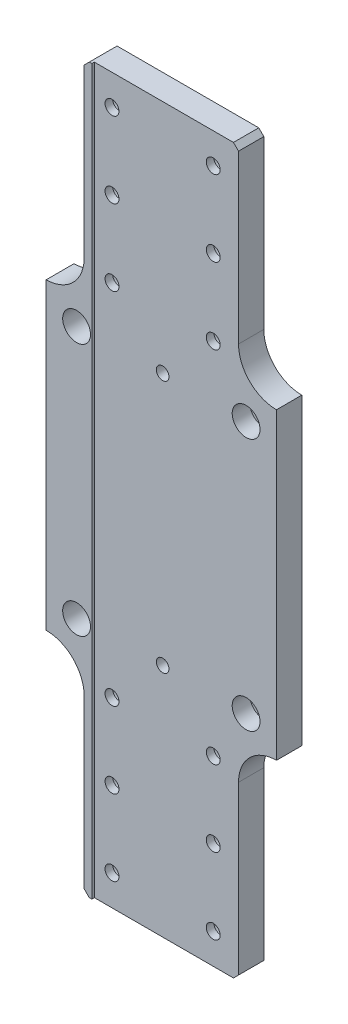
ISO-10303-21;
HEADER;
FILE_DESCRIPTION(('STEP AP214'),'2;1');
FILE_NAME('part.step','',(''),(''),'','','');
FILE_SCHEMA(('AUTOMOTIVE_DESIGN { 1 0 10303 214 1 1 1 1 }'));
ENDSEC;
DATA;
#1=APPLICATION_CONTEXT('core data for automotive mechanical design processes');
#2=APPLICATION_PROTOCOL_DEFINITION('international standard','automotive_design',2000,#1);
#3=PRODUCT_CONTEXT('',#1,'mechanical');
#4=PRODUCT('Part','Part','',(#3));
#5=PRODUCT_RELATED_PRODUCT_CATEGORY('part','',(#4));
#6=PRODUCT_DEFINITION_FORMATION('','',#4);
#7=PRODUCT_DEFINITION_CONTEXT('part definition',#1,'design');
#8=PRODUCT_DEFINITION('design','',#6,#7);
#9=PRODUCT_DEFINITION_SHAPE('','',#8);
#10=(LENGTH_UNIT() NAMED_UNIT(*) SI_UNIT(.MILLI.,.METRE.));
#11=(NAMED_UNIT(*) PLANE_ANGLE_UNIT() SI_UNIT($,.RADIAN.));
#12=(NAMED_UNIT(*) SI_UNIT($,.STERADIAN.) SOLID_ANGLE_UNIT());
#13=UNCERTAINTY_MEASURE_WITH_UNIT(LENGTH_MEASURE(1.E-05),#10,'distance_accuracy_value','');
#14=(GEOMETRIC_REPRESENTATION_CONTEXT(3) GLOBAL_UNCERTAINTY_ASSIGNED_CONTEXT((#13)) GLOBAL_UNIT_ASSIGNED_CONTEXT((#10,
#11,#12)) REPRESENTATION_CONTEXT('',''));
#15=CARTESIAN_POINT('',(0.,0.,0.));
#16=DIRECTION('',(0.,0.,1.));
#17=DIRECTION('',(1.,0.,0.));
#18=AXIS2_PLACEMENT_3D('',#15,#16,#17);
#19=CARTESIAN_POINT('',(0.,0.,-5.5));
#20=DIRECTION('',(0.,0.,1.));
#21=DIRECTION('',(1.,0.,0.));
#22=AXIS2_PLACEMENT_3D('',#19,#20,#21);
#23=PLANE('',#22);
#24=CARTESIAN_POINT('',(20.,-71.,-5.5));
#25=DIRECTION('',(0.,0.,-1.));
#26=DIRECTION('',(-1.,0.,0.));
#27=AXIS2_PLACEMENT_3D('',#24,#25,#26);
#28=CIRCLE('',#27,4.75);
#29=CARTESIAN_POINT('',(15.25,-71.,-5.5));
#30=VERTEX_POINT('',#29);
#31=EDGE_CURVE('E1215',#30,#30,#28,.T.);
#32=ORIENTED_EDGE('',*,*,#31,.F.);
#33=EDGE_LOOP('',(#32));
#34=FACE_BOUND('',#33,.T.);
#35=CARTESIAN_POINT('',(-20.,-71.,-5.5));
#36=DIRECTION('',(0.,0.,-1.));
#37=DIRECTION('',(-1.,0.,0.));
#38=AXIS2_PLACEMENT_3D('',#35,#36,#37);
#39=CIRCLE('',#38,4.75);
#40=CARTESIAN_POINT('',(-24.75,-71.,-5.5));
#41=VERTEX_POINT('',#40);
#42=EDGE_CURVE('E312',#41,#41,#39,.T.);
#43=ORIENTED_EDGE('',*,*,#42,.F.);
#44=EDGE_LOOP('',(#43));
#45=FACE_BOUND('',#44,.T.);
#46=CARTESIAN_POINT('',(20.,-101.,-5.5));
#47=DIRECTION('',(0.,0.,-1.));
#48=DIRECTION('',(-1.,0.,0.));
#49=AXIS2_PLACEMENT_3D('',#46,#47,#48);
#50=CIRCLE('',#49,4.75);
#51=CARTESIAN_POINT('',(15.25,-101.,-5.5));
#52=VERTEX_POINT('',#51);
#53=EDGE_CURVE('E307',#52,#52,#50,.T.);
#54=ORIENTED_EDGE('',*,*,#53,.F.);
#55=EDGE_LOOP('',(#54));
#56=FACE_BOUND('',#55,.T.);
#57=CARTESIAN_POINT('',(20.,-131.,-5.5));
#58=DIRECTION('',(0.,0.,-1.));
#59=DIRECTION('',(-1.,0.,0.));
#60=AXIS2_PLACEMENT_3D('',#57,#58,#59);
#61=CIRCLE('',#60,4.75);
#62=CARTESIAN_POINT('',(15.25,-131.,-5.5));
#63=VERTEX_POINT('',#62);
#64=EDGE_CURVE('E297',#63,#63,#61,.T.);
#65=ORIENTED_EDGE('',*,*,#64,.F.);
#66=EDGE_LOOP('',(#65));
#67=FACE_BOUND('',#66,.T.);
#68=CARTESIAN_POINT('',(-20.,-131.,-5.5));
#69=DIRECTION('',(0.,0.,-1.));
#70=DIRECTION('',(-1.,0.,0.));
#71=AXIS2_PLACEMENT_3D('',#68,#69,#70);
#72=CIRCLE('',#71,4.75);
#73=CARTESIAN_POINT('',(-24.75,-131.,-5.5));
#74=VERTEX_POINT('',#73);
#75=EDGE_CURVE('E292',#74,#74,#72,.T.);
#76=ORIENTED_EDGE('',*,*,#75,.F.);
#77=EDGE_LOOP('',(#76));
#78=FACE_BOUND('',#77,.T.);
#79=CARTESIAN_POINT('',(20.,131.,-5.5));
#80=DIRECTION('',(0.,0.,-1.));
#81=DIRECTION('',(-1.,0.,0.));
#82=AXIS2_PLACEMENT_3D('',#79,#80,#81);
#83=CIRCLE('',#82,4.75);
#84=CARTESIAN_POINT('',(15.25,131.,-5.5));
#85=VERTEX_POINT('',#84);
#86=EDGE_CURVE('E287',#85,#85,#83,.T.);
#87=ORIENTED_EDGE('',*,*,#86,.F.);
#88=EDGE_LOOP('',(#87));
#89=FACE_BOUND('',#88,.T.);
#90=CARTESIAN_POINT('',(-20.,131.,-5.5));
#91=DIRECTION('',(0.,0.,-1.));
#92=DIRECTION('',(-1.,0.,0.));
#93=AXIS2_PLACEMENT_3D('',#90,#91,#92);
#94=CIRCLE('',#93,4.75);
#95=CARTESIAN_POINT('',(-24.75,131.,-5.5));
#96=VERTEX_POINT('',#95);
#97=EDGE_CURVE('E282',#96,#96,#94,.T.);
#98=ORIENTED_EDGE('',*,*,#97,.F.);
#99=EDGE_LOOP('',(#98));
#100=FACE_BOUND('',#99,.T.);
#101=CARTESIAN_POINT('',(20.,101.,-5.5));
#102=DIRECTION('',(0.,0.,-1.));
#103=DIRECTION('',(-1.,0.,0.));
#104=AXIS2_PLACEMENT_3D('',#101,#102,#103);
#105=CIRCLE('',#104,4.75);
#106=CARTESIAN_POINT('',(15.25,101.,-5.5));
#107=VERTEX_POINT('',#106);
#108=EDGE_CURVE('E277',#107,#107,#105,.T.);
#109=ORIENTED_EDGE('',*,*,#108,.F.);
#110=EDGE_LOOP('',(#109));
#111=FACE_BOUND('',#110,.T.);
#112=CARTESIAN_POINT('',(-20.,101.,-5.5));
#113=DIRECTION('',(0.,0.,-1.));
#114=DIRECTION('',(-1.,0.,0.));
#115=AXIS2_PLACEMENT_3D('',#112,#113,#114);
#116=CIRCLE('',#115,4.75);
#117=CARTESIAN_POINT('',(-24.75,101.,-5.5));
#118=VERTEX_POINT('',#117);
#119=EDGE_CURVE('E272',#118,#118,#116,.T.);
#120=ORIENTED_EDGE('',*,*,#119,.F.);
#121=EDGE_LOOP('',(#120));
#122=FACE_BOUND('',#121,.T.);
#123=CARTESIAN_POINT('',(20.,71.,-5.5));
#124=DIRECTION('',(0.,0.,-1.));
#125=DIRECTION('',(-1.,0.,0.));
#126=AXIS2_PLACEMENT_3D('',#123,#124,#125);
#127=CIRCLE('',#126,4.75);
#128=CARTESIAN_POINT('',(15.25,71.,-5.5));
#129=VERTEX_POINT('',#128);
#130=EDGE_CURVE('E267',#129,#129,#127,.T.);
#131=ORIENTED_EDGE('',*,*,#130,.F.);
#132=EDGE_LOOP('',(#131));
#133=FACE_BOUND('',#132,.T.);
#134=CARTESIAN_POINT('',(-20.,71.,-5.5));
#135=DIRECTION('',(0.,0.,-1.));
#136=DIRECTION('',(-1.,0.,0.));
#137=AXIS2_PLACEMENT_3D('',#134,#135,#136);
#138=CIRCLE('',#137,4.75);
#139=CARTESIAN_POINT('',(-24.75,71.,-5.5));
#140=VERTEX_POINT('',#139);
#141=EDGE_CURVE('E262',#140,#140,#138,.T.);
#142=ORIENTED_EDGE('',*,*,#141,.F.);
#143=EDGE_LOOP('',(#142));
#144=FACE_BOUND('',#143,.T.);
#145=CARTESIAN_POINT('',(0.,50.,-5.5));
#146=DIRECTION('',(0.,0.,1.));
#147=DIRECTION('',(1.,0.,0.));
#148=AXIS2_PLACEMENT_3D('',#145,#146,#147);
#149=CIRCLE('',#148,2.5);
#150=CARTESIAN_POINT('',(2.5,50.,-5.5));
#151=VERTEX_POINT('',#150);
#152=EDGE_CURVE('E1128',#151,#151,#149,.T.);
#153=ORIENTED_EDGE('',*,*,#152,.T.);
#154=EDGE_LOOP('',(#153));
#155=FACE_BOUND('',#154,.T.);
#156=CARTESIAN_POINT('',(0.,-50.,-5.5));
#157=DIRECTION('',(0.,0.,1.));
#158=DIRECTION('',(1.,0.,0.));
#159=AXIS2_PLACEMENT_3D('',#156,#157,#158);
#160=CIRCLE('',#159,2.5);
#161=CARTESIAN_POINT('',(2.5,-50.,-5.5));
#162=VERTEX_POINT('',#161);
#163=EDGE_CURVE('E1122',#162,#162,#160,.T.);
#164=ORIENTED_EDGE('',*,*,#163,.T.);
#165=EDGE_LOOP('',(#164));
#166=FACE_BOUND('',#165,.T.);
#167=CARTESIAN_POINT('',(-33.,50.,-5.5));
#168=DIRECTION('',(0.,0.,1.));
#169=DIRECTION('',(1.,0.,0.));
#170=AXIS2_PLACEMENT_3D('',#167,#168,#169);
#171=CIRCLE('',#170,3.3);
#172=CARTESIAN_POINT('',(-29.7,50.,-5.5));
#173=VERTEX_POINT('',#172);
#174=EDGE_CURVE('E1112',#173,#173,#171,.T.);
#175=ORIENTED_EDGE('',*,*,#174,.T.);
#176=EDGE_LOOP('',(#175));
#177=FACE_BOUND('',#176,.T.);
#178=CARTESIAN_POINT('',(33.,50.,-5.5));
#179=DIRECTION('',(0.,0.,1.));
#180=DIRECTION('',(1.,0.,0.));
#181=AXIS2_PLACEMENT_3D('',#178,#179,#180);
#182=CIRCLE('',#181,3.3);
#183=CARTESIAN_POINT('',(36.3,50.,-5.5));
#184=VERTEX_POINT('',#183);
#185=EDGE_CURVE('E253',#184,#184,#182,.T.);
#186=ORIENTED_EDGE('',*,*,#185,.T.);
#187=EDGE_LOOP('',(#186));
#188=FACE_BOUND('',#187,.T.);
#189=CARTESIAN_POINT('',(-33.,-50.,-5.5));
#190=DIRECTION('',(0.,0.,1.));
#191=DIRECTION('',(1.,0.,0.));
#192=AXIS2_PLACEMENT_3D('',#189,#190,#191);
#193=CIRCLE('',#192,3.3);
#194=CARTESIAN_POINT('',(-29.7,-50.,-5.5));
#195=VERTEX_POINT('',#194);
#196=EDGE_CURVE('E1083',#195,#195,#193,.T.);
#197=ORIENTED_EDGE('',*,*,#196,.T.);
#198=EDGE_LOOP('',(#197));
#199=FACE_BOUND('',#198,.T.);
#200=CARTESIAN_POINT('',(33.,-50.,-5.5));
#201=DIRECTION('',(0.,0.,1.));
#202=DIRECTION('',(1.,0.,0.));
#203=AXIS2_PLACEMENT_3D('',#200,#201,#202);
#204=CIRCLE('',#203,3.3);
#205=CARTESIAN_POINT('',(36.3,-50.,-5.5));
#206=VERTEX_POINT('',#205);
#207=EDGE_CURVE('E248',#206,#206,#204,.T.);
#208=ORIENTED_EDGE('',*,*,#207,.T.);
#209=EDGE_LOOP('',(#208));
#210=FACE_BOUND('',#209,.T.);
#211=DIRECTION('',(0.,1.,0.));
#212=VECTOR('',#211,1.);
#213=CARTESIAN_POINT('',(30.,0.,-5.5));
#214=LINE('',#213,#212);
#215=CARTESIAN_POINT('',(30.,-141.,-5.5));
#216=VERTEX_POINT('',#215);
#217=CARTESIAN_POINT('',(30.,-75.,-5.5));
#218=VERTEX_POINT('',#217);
#219=EDGE_CURVE('E224',#216,#218,#214,.T.);
#220=ORIENTED_EDGE('',*,*,#219,.F.);
#221=DIRECTION('',(0.707106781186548,0.707106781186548,0.));
#222=VECTOR('',#221,1.);
#223=CARTESIAN_POINT('',(30.,-141.,-5.5));
#224=LINE('',#223,#222);
#225=CARTESIAN_POINT('',(28.,-143.,-5.5));
#226=VERTEX_POINT('',#225);
#227=EDGE_CURVE('E351',#216,#226,#224,.F.);
#228=ORIENTED_EDGE('',*,*,#227,.T.);
#229=DIRECTION('',(1.,0.,0.));
#230=VECTOR('',#229,1.);
#231=CARTESIAN_POINT('',(0.,-143.,-5.5));
#232=LINE('',#231,#230);
#233=CARTESIAN_POINT('',(-28.,-143.,-5.5));
#234=VERTEX_POINT('',#233);
#235=EDGE_CURVE('E222',#234,#226,#232,.T.);
#236=ORIENTED_EDGE('',*,*,#235,.F.);
#237=DIRECTION('',(-0.707106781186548,0.707106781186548,0.));
#238=VECTOR('',#237,1.);
#239=CARTESIAN_POINT('',(-28.,-143.,-5.5));
#240=LINE('',#239,#238);
#241=CARTESIAN_POINT('',(-30.,-141.,-5.5));
#242=VERTEX_POINT('',#241);
#243=EDGE_CURVE('E349',#234,#242,#240,.T.);
#244=ORIENTED_EDGE('',*,*,#243,.T.);
#245=DIRECTION('',(0.,1.,0.));
#246=VECTOR('',#245,1.);
#247=CARTESIAN_POINT('',(-30.,0.,-5.5));
#248=LINE('',#247,#246);
#249=CARTESIAN_POINT('',(-30.,-75.,-5.5));
#250=VERTEX_POINT('',#249);
#251=EDGE_CURVE('E220',#242,#250,#248,.T.);
#252=ORIENTED_EDGE('',*,*,#251,.T.);
#253=CARTESIAN_POINT('',(-45.,-75.,-5.5));
#254=DIRECTION('',(0.,0.,1.));
#255=DIRECTION('',(1.,0.,0.));
#256=AXIS2_PLACEMENT_3D('',#253,#254,#255);
#257=CIRCLE('',#256,15.);
#258=CARTESIAN_POINT('',(-45.,-60.,-5.5));
#259=VERTEX_POINT('',#258);
#260=EDGE_CURVE('E324',#250,#259,#257,.T.);
#261=ORIENTED_EDGE('',*,*,#260,.T.);
#262=DIRECTION('',(0.,-1.,0.));
#263=VECTOR('',#262,1.);
#264=CARTESIAN_POINT('',(-45.,60.,-5.5));
#265=LINE('',#264,#263);
#266=CARTESIAN_POINT('',(-45.,60.,-5.5));
#267=VERTEX_POINT('',#266);
#268=EDGE_CURVE('E202',#267,#259,#265,.T.);
#269=ORIENTED_EDGE('',*,*,#268,.F.);
#270=CARTESIAN_POINT('',(-45.,75.,-5.5));
#271=DIRECTION('',(0.,0.,1.));
#272=DIRECTION('',(1.,0.,0.));
#273=AXIS2_PLACEMENT_3D('',#270,#271,#272);
#274=CIRCLE('',#273,15.);
#275=CARTESIAN_POINT('',(-30.,75.,-5.5));
#276=VERTEX_POINT('',#275);
#277=EDGE_CURVE('E338',#267,#276,#274,.T.);
#278=ORIENTED_EDGE('',*,*,#277,.T.);
#279=DIRECTION('',(0.,1.,0.));
#280=VECTOR('',#279,1.);
#281=CARTESIAN_POINT('',(-30.,0.,-5.5));
#282=LINE('',#281,#280);
#283=CARTESIAN_POINT('',(-30.,141.,-5.5));
#284=VERTEX_POINT('',#283);
#285=EDGE_CURVE('E206',#276,#284,#282,.T.);
#286=ORIENTED_EDGE('',*,*,#285,.T.);
#287=DIRECTION('',(-0.707106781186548,-0.707106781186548,0.));
#288=VECTOR('',#287,1.);
#289=CARTESIAN_POINT('',(-30.,141.,-5.5));
#290=LINE('',#289,#288);
#291=CARTESIAN_POINT('',(-28.,143.,-5.5));
#292=VERTEX_POINT('',#291);
#293=EDGE_CURVE('E345',#284,#292,#290,.F.);
#294=ORIENTED_EDGE('',*,*,#293,.T.);
#295=DIRECTION('',(1.,0.,0.));
#296=VECTOR('',#295,1.);
#297=CARTESIAN_POINT('',(0.,143.,-5.5));
#298=LINE('',#297,#296);
#299=CARTESIAN_POINT('',(28.,143.,-5.5));
#300=VERTEX_POINT('',#299);
#301=EDGE_CURVE('E212',#292,#300,#298,.T.);
#302=ORIENTED_EDGE('',*,*,#301,.T.);
#303=DIRECTION('',(0.707106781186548,-0.707106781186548,0.));
#304=VECTOR('',#303,1.);
#305=CARTESIAN_POINT('',(28.,143.,-5.5));
#306=LINE('',#305,#304);
#307=CARTESIAN_POINT('',(30.,141.,-5.5));
#308=VERTEX_POINT('',#307);
#309=EDGE_CURVE('E347',#300,#308,#306,.T.);
#310=ORIENTED_EDGE('',*,*,#309,.T.);
#311=DIRECTION('',(0.,1.,0.));
#312=VECTOR('',#311,1.);
#313=CARTESIAN_POINT('',(30.,0.,-5.5));
#314=LINE('',#313,#312);
#315=CARTESIAN_POINT('',(30.,75.,-5.5));
#316=VERTEX_POINT('',#315);
#317=EDGE_CURVE('E209',#316,#308,#314,.T.);
#318=ORIENTED_EDGE('',*,*,#317,.F.);
#319=CARTESIAN_POINT('',(45.,75.,-5.5));
#320=DIRECTION('',(0.,0.,1.));
#321=DIRECTION('',(1.,0.,0.));
#322=AXIS2_PLACEMENT_3D('',#319,#320,#321);
#323=CIRCLE('',#322,15.);
#324=CARTESIAN_POINT('',(45.,60.,-5.5));
#325=VERTEX_POINT('',#324);
#326=EDGE_CURVE('E334',#316,#325,#323,.T.);
#327=ORIENTED_EDGE('',*,*,#326,.T.);
#328=DIRECTION('',(0.,-1.,0.));
#329=VECTOR('',#328,1.);
#330=CARTESIAN_POINT('',(45.,60.,-5.5));
#331=LINE('',#330,#329);
#332=CARTESIAN_POINT('',(45.,-60.,-5.5));
#333=VERTEX_POINT('',#332);
#334=EDGE_CURVE('E231',#325,#333,#331,.T.);
#335=ORIENTED_EDGE('',*,*,#334,.T.);
#336=CARTESIAN_POINT('',(45.,-75.,-5.5));
#337=DIRECTION('',(0.,0.,1.));
#338=DIRECTION('',(1.,0.,0.));
#339=AXIS2_PLACEMENT_3D('',#336,#337,#338);
#340=CIRCLE('',#339,15.);
#341=EDGE_CURVE('E329',#333,#218,#340,.T.);
#342=ORIENTED_EDGE('',*,*,#341,.T.);
#343=EDGE_LOOP('',(#220,#228,#236,#244,#252,#261,#269,#278,#286,#294,#302,#310,#318,#327,#335,#342));
#344=FACE_BOUND('',#343,.T.);
#345=CARTESIAN_POINT('',(-20.,-101.,-5.5));
#346=DIRECTION('',(0.,0.,-1.));
#347=DIRECTION('',(-1.,0.,0.));
#348=AXIS2_PLACEMENT_3D('',#345,#346,#347);
#349=CIRCLE('',#348,4.75);
#350=CARTESIAN_POINT('',(-24.75,-101.,-5.5));
#351=VERTEX_POINT('',#350);
#352=EDGE_CURVE('E302',#351,#351,#349,.T.);
#353=ORIENTED_EDGE('',*,*,#352,.F.);
#354=EDGE_LOOP('',(#353));
#355=FACE_BOUND('',#354,.T.);
#356=ADVANCED_FACE('F35',(#34,#45,#56,#67,#78,#89,#100,#111,#122,#133,#144,#155,#166,#177,#188,
#199,#210,#344,#355),#23,.F.);
#357=CARTESIAN_POINT('',(30.,0.,5.5));
#358=DIRECTION('',(-1.,0.,0.));
#359=DIRECTION('',(0.,0.,1.));
#360=AXIS2_PLACEMENT_3D('',#357,#358,#359);
#361=PLANE('',#360);
#362=ORIENTED_EDGE('',*,*,#317,.T.);
#363=DIRECTION('',(0.,0.,1.));
#364=VECTOR('',#363,1.);
#365=CARTESIAN_POINT('',(30.,141.,4.5));
#366=LINE('',#365,#364);
#367=CARTESIAN_POINT('',(30.,141.,4.5));
#368=VERTEX_POINT('',#367);
#369=EDGE_CURVE('E43',#308,#368,#366,.T.);
#370=ORIENTED_EDGE('',*,*,#369,.T.);
#371=DIRECTION('',(0.,1.,0.));
#372=VECTOR('',#371,1.);
#373=CARTESIAN_POINT('',(30.,0.,4.5));
#374=LINE('',#373,#372);
#375=CARTESIAN_POINT('',(30.,75.,4.5));
#376=VERTEX_POINT('',#375);
#377=EDGE_CURVE('E196',#376,#368,#374,.T.);
#378=ORIENTED_EDGE('',*,*,#377,.F.);
#379=DIRECTION('',(0.,0.,-1.));
#380=VECTOR('',#379,1.);
#381=CARTESIAN_POINT('',(30.,75.,5.5));
#382=LINE('',#381,#380);
#383=EDGE_CURVE('E319',#376,#316,#382,.T.);
#384=ORIENTED_EDGE('',*,*,#383,.T.);
#385=EDGE_LOOP('',(#362,#370,#378,#384));
#386=FACE_BOUND('',#385,.T.);
#387=ADVANCED_FACE('F372',(#386),#361,.F.);
#388=CARTESIAN_POINT('',(30.,0.,5.5));
#389=DIRECTION('',(-1.,0.,0.));
#390=DIRECTION('',(0.,0.,1.));
#391=AXIS2_PLACEMENT_3D('',#388,#389,#390);
#392=PLANE('',#391);
#393=DIRECTION('',(0.,1.,0.));
#394=VECTOR('',#393,1.);
#395=CARTESIAN_POINT('',(30.,0.,4.5));
#396=LINE('',#395,#394);
#397=CARTESIAN_POINT('',(30.,-141.,4.5));
#398=VERTEX_POINT('',#397);
#399=CARTESIAN_POINT('',(30.,-75.,4.5));
#400=VERTEX_POINT('',#399);
#401=EDGE_CURVE('E200',#398,#400,#396,.T.);
#402=ORIENTED_EDGE('',*,*,#401,.F.);
#403=DIRECTION('',(0.,0.,-1.));
#404=VECTOR('',#403,1.);
#405=CARTESIAN_POINT('',(30.,-141.,5.5));
#406=LINE('',#405,#404);
#407=EDGE_CURVE('E342',#398,#216,#406,.T.);
#408=ORIENTED_EDGE('',*,*,#407,.T.);
#409=ORIENTED_EDGE('',*,*,#219,.T.);
#410=DIRECTION('',(0.,0.,-1.));
#411=VECTOR('',#410,1.);
#412=CARTESIAN_POINT('',(30.,-75.,4.5));
#413=LINE('',#412,#411);
#414=EDGE_CURVE('E316',#218,#400,#413,.F.);
#415=ORIENTED_EDGE('',*,*,#414,.T.);
#416=EDGE_LOOP('',(#402,#408,#409,#415));
#417=FACE_BOUND('',#416,.T.);
#418=ADVANCED_FACE('F420',(#417),#392,.F.);
#419=CARTESIAN_POINT('',(45.,60.,5.5));
#420=DIRECTION('',(1.,0.,0.));
#421=DIRECTION('',(0.,1.,0.));
#422=AXIS2_PLACEMENT_3D('',#419,#420,#421);
#423=PLANE('',#422);
#424=DIRECTION('',(0.,0.,-1.));
#425=VECTOR('',#424,1.);
#426=CARTESIAN_POINT('',(45.,60.,5.5));
#427=LINE('',#426,#425);
#428=CARTESIAN_POINT('',(45.,60.,4.5));
#429=VERTEX_POINT('',#428);
#430=EDGE_CURVE('E238',#429,#325,#427,.T.);
#431=ORIENTED_EDGE('',*,*,#430,.F.);
#432=DIRECTION('',(0.,1.,0.));
#433=VECTOR('',#432,1.);
#434=CARTESIAN_POINT('',(45.,143.,4.5));
#435=LINE('',#434,#433);
#436=CARTESIAN_POINT('',(45.,-60.,4.5));
#437=VERTEX_POINT('',#436);
#438=EDGE_CURVE('E188',#437,#429,#435,.T.);
#439=ORIENTED_EDGE('',*,*,#438,.F.);
#440=DIRECTION('',(0.,0.,-1.));
#441=VECTOR('',#440,1.);
#442=CARTESIAN_POINT('',(45.,-60.,5.5));
#443=LINE('',#442,#441);
#444=EDGE_CURVE('E241',#437,#333,#443,.T.);
#445=ORIENTED_EDGE('',*,*,#444,.T.);
#446=ORIENTED_EDGE('',*,*,#334,.F.);
#447=EDGE_LOOP('',(#431,#439,#445,#446));
#448=FACE_BOUND('',#447,.T.);
#449=ADVANCED_FACE('F428',(#448),#423,.T.);
#450=CARTESIAN_POINT('',(0.,143.,5.5));
#451=DIRECTION('',(0.,1.,0.));
#452=DIRECTION('',(-1.,0.,0.));
#453=AXIS2_PLACEMENT_3D('',#450,#451,#452);
#454=PLANE('',#453);
#455=DIRECTION('',(-1.,0.,0.));
#456=VECTOR('',#455,1.);
#457=CARTESIAN_POINT('',(-27.,143.,4.5));
#458=LINE('',#457,#456);
#459=CARTESIAN_POINT('',(28.,143.,4.5));
#460=VERTEX_POINT('',#459);
#461=CARTESIAN_POINT('',(-27.,143.,4.5));
#462=VERTEX_POINT('',#461);
#463=EDGE_CURVE('E175',#460,#462,#458,.T.);
#464=ORIENTED_EDGE('',*,*,#463,.F.);
#465=DIRECTION('',(0.,0.,-1.));
#466=VECTOR('',#465,1.);
#467=CARTESIAN_POINT('',(28.,143.,-5.5));
#468=LINE('',#467,#466);
#469=EDGE_CURVE('E367',#460,#300,#468,.T.);
#470=ORIENTED_EDGE('',*,*,#469,.T.);
#471=ORIENTED_EDGE('',*,*,#301,.F.);
#472=DIRECTION('',(0.,0.,1.));
#473=VECTOR('',#472,1.);
#474=CARTESIAN_POINT('',(-28.,143.,5.5));
#475=LINE('',#474,#473);
#476=CARTESIAN_POINT('',(-28.,143.,5.5));
#477=VERTEX_POINT('',#476);
#478=EDGE_CURVE('E58',#292,#477,#475,.T.);
#479=ORIENTED_EDGE('',*,*,#478,.T.);
#480=DIRECTION('',(1.,0.,0.));
#481=VECTOR('',#480,1.);
#482=CARTESIAN_POINT('',(0.,143.,5.5));
#483=LINE('',#482,#481);
#484=CARTESIAN_POINT('',(-27.,143.,5.5));
#485=VERTEX_POINT('',#484);
#486=EDGE_CURVE('E203',#477,#485,#483,.T.);
#487=ORIENTED_EDGE('',*,*,#486,.T.);
#488=DIRECTION('',(0.,0.,1.));
#489=VECTOR('',#488,1.);
#490=CARTESIAN_POINT('',(-27.,143.,4.5));
#491=LINE('',#490,#489);
#492=EDGE_CURVE('E174',#462,#485,#491,.T.);
#493=ORIENTED_EDGE('',*,*,#492,.F.);
#494=EDGE_LOOP('',(#464,#470,#471,#479,#487,#493));
#495=FACE_BOUND('',#494,.T.);
#496=ADVANCED_FACE('F380',(#495),#454,.T.);
#497=CARTESIAN_POINT('',(-30.,0.,5.5));
#498=DIRECTION('',(-1.,0.,0.));
#499=DIRECTION('',(0.,0.,1.));
#500=AXIS2_PLACEMENT_3D('',#497,#498,#499);
#501=PLANE('',#500);
#502=DIRECTION('',(0.,1.,0.));
#503=VECTOR('',#502,1.);
#504=CARTESIAN_POINT('',(-30.,0.,5.5));
#505=LINE('',#504,#503);
#506=CARTESIAN_POINT('',(-30.,75.,5.5));
#507=VERTEX_POINT('',#506);
#508=CARTESIAN_POINT('',(-30.,141.,5.5));
#509=VERTEX_POINT('',#508);
#510=EDGE_CURVE('E205',#507,#509,#505,.T.);
#511=ORIENTED_EDGE('',*,*,#510,.T.);
#512=DIRECTION('',(0.,0.,-1.));
#513=VECTOR('',#512,1.);
#514=CARTESIAN_POINT('',(-30.,141.,5.5));
#515=LINE('',#514,#513);
#516=EDGE_CURVE('E11',#509,#284,#515,.T.);
#517=ORIENTED_EDGE('',*,*,#516,.T.);
#518=ORIENTED_EDGE('',*,*,#285,.F.);
#519=DIRECTION('',(0.,0.,-1.));
#520=VECTOR('',#519,1.);
#521=CARTESIAN_POINT('',(-30.,75.,5.5));
#522=LINE('',#521,#520);
#523=EDGE_CURVE('E322',#276,#507,#522,.F.);
#524=ORIENTED_EDGE('',*,*,#523,.T.);
#525=EDGE_LOOP('',(#511,#517,#518,#524));
#526=FACE_BOUND('',#525,.T.);
#527=ADVANCED_FACE('F388',(#526),#501,.T.);
#528=CARTESIAN_POINT('',(0.,0.,5.5));
#529=DIRECTION('',(0.,0.,1.));
#530=DIRECTION('',(1.,0.,0.));
#531=AXIS2_PLACEMENT_3D('',#528,#529,#530);
#532=PLANE('',#531);
#533=CARTESIAN_POINT('',(-33.,50.,5.5));
#534=DIRECTION('',(0.,0.,1.));
#535=DIRECTION('',(1.,0.,0.));
#536=AXIS2_PLACEMENT_3D('',#533,#534,#535);
#537=CIRCLE('',#536,5.5);
#538=CARTESIAN_POINT('',(-27.5,50.,5.5));
#539=VERTEX_POINT('',#538);
#540=EDGE_CURVE('E1069',#539,#539,#537,.T.);
#541=ORIENTED_EDGE('',*,*,#540,.F.);
#542=EDGE_LOOP('',(#541));
#543=FACE_BOUND('',#542,.T.);
#544=CARTESIAN_POINT('',(-33.,-50.,5.5));
#545=DIRECTION('',(0.,0.,1.));
#546=DIRECTION('',(1.,0.,0.));
#547=AXIS2_PLACEMENT_3D('',#544,#545,#546);
#548=CIRCLE('',#547,5.5);
#549=CARTESIAN_POINT('',(-27.5,-50.,5.5));
#550=VERTEX_POINT('',#549);
#551=EDGE_CURVE('E252',#550,#550,#548,.T.);
#552=ORIENTED_EDGE('',*,*,#551,.F.);
#553=EDGE_LOOP('',(#552));
#554=FACE_BOUND('',#553,.T.);
#555=DIRECTION('',(0.,1.,0.));
#556=VECTOR('',#555,1.);
#557=CARTESIAN_POINT('',(-30.,0.,5.5));
#558=LINE('',#557,#556);
#559=CARTESIAN_POINT('',(-30.,-141.,5.5));
#560=VERTEX_POINT('',#559);
#561=CARTESIAN_POINT('',(-30.,-75.,5.5));
#562=VERTEX_POINT('',#561);
#563=EDGE_CURVE('E213',#560,#562,#558,.T.);
#564=ORIENTED_EDGE('',*,*,#563,.F.);
#565=DIRECTION('',(0.707106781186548,-0.707106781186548,0.));
#566=VECTOR('',#565,1.);
#567=CARTESIAN_POINT('',(-85.5,-85.5,5.5));
#568=LINE('',#567,#566);
#569=CARTESIAN_POINT('',(-28.,-143.,5.5));
#570=VERTEX_POINT('',#569);
#571=EDGE_CURVE('E364',#560,#570,#568,.T.);
#572=ORIENTED_EDGE('',*,*,#571,.T.);
#573=DIRECTION('',(1.,0.,0.));
#574=VECTOR('',#573,1.);
#575=CARTESIAN_POINT('',(0.,-143.,5.5));
#576=LINE('',#575,#574);
#577=CARTESIAN_POINT('',(-27.,-143.,5.5));
#578=VERTEX_POINT('',#577);
#579=EDGE_CURVE('E218',#570,#578,#576,.T.);
#580=ORIENTED_EDGE('',*,*,#579,.T.);
#581=DIRECTION('',(0.,-1.,0.));
#582=VECTOR('',#581,1.);
#583=CARTESIAN_POINT('',(-27.,143.,5.5));
#584=LINE('',#583,#582);
#585=EDGE_CURVE('E170',#485,#578,#584,.T.);
#586=ORIENTED_EDGE('',*,*,#585,.F.);
#587=ORIENTED_EDGE('',*,*,#486,.F.);
#588=DIRECTION('',(0.707106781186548,0.707106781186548,0.));
#589=VECTOR('',#588,1.);
#590=CARTESIAN_POINT('',(-85.5,85.5,5.5));
#591=LINE('',#590,#589);
#592=EDGE_CURVE('E50',#477,#509,#591,.F.);
#593=ORIENTED_EDGE('',*,*,#592,.T.);
#594=ORIENTED_EDGE('',*,*,#510,.F.);
#595=CARTESIAN_POINT('',(-45.,75.,5.5));
#596=DIRECTION('',(0.,0.,1.));
#597=DIRECTION('',(1.,0.,0.));
#598=AXIS2_PLACEMENT_3D('',#595,#596,#597);
#599=CIRCLE('',#598,15.);
#600=CARTESIAN_POINT('',(-45.,60.,5.5));
#601=VERTEX_POINT('',#600);
#602=EDGE_CURVE('E340',#507,#601,#599,.F.);
#603=ORIENTED_EDGE('',*,*,#602,.T.);
#604=DIRECTION('',(0.,-1.,0.));
#605=VECTOR('',#604,1.);
#606=CARTESIAN_POINT('',(-45.,60.,5.5));
#607=LINE('',#606,#605);
#608=CARTESIAN_POINT('',(-45.,-60.,5.5));
#609=VERTEX_POINT('',#608);
#610=EDGE_CURVE('E228',#601,#609,#607,.T.);
#611=ORIENTED_EDGE('',*,*,#610,.T.);
#612=CARTESIAN_POINT('',(-45.,-75.,5.5));
#613=DIRECTION('',(0.,0.,1.));
#614=DIRECTION('',(1.,0.,0.));
#615=AXIS2_PLACEMENT_3D('',#612,#613,#614);
#616=CIRCLE('',#615,15.);
#617=EDGE_CURVE('E326',#609,#562,#616,.F.);
#618=ORIENTED_EDGE('',*,*,#617,.T.);
#619=EDGE_LOOP('',(#564,#572,#580,#586,#587,#593,#594,#603,#611,#618));
#620=FACE_BOUND('',#619,.T.);
#621=ADVANCED_FACE('F392',(#543,#554,#620),#532,.T.);
#622=CARTESIAN_POINT('',(0.,-143.,5.5));
#623=DIRECTION('',(0.,1.,0.));
#624=DIRECTION('',(0.,0.,1.));
#625=AXIS2_PLACEMENT_3D('',#622,#623,#624);
#626=PLANE('',#625);
#627=ORIENTED_EDGE('',*,*,#235,.T.);
#628=DIRECTION('',(0.,0.,1.));
#629=VECTOR('',#628,1.);
#630=CARTESIAN_POINT('',(28.,-143.,5.5));
#631=LINE('',#630,#629);
#632=CARTESIAN_POINT('',(28.,-143.,4.5));
#633=VERTEX_POINT('',#632);
#634=EDGE_CURVE('E187',#226,#633,#631,.T.);
#635=ORIENTED_EDGE('',*,*,#634,.T.);
#636=DIRECTION('',(1.,0.,0.));
#637=VECTOR('',#636,1.);
#638=CARTESIAN_POINT('',(-27.,-143.,4.5));
#639=LINE('',#638,#637);
#640=CARTESIAN_POINT('',(-27.,-143.,4.5));
#641=VERTEX_POINT('',#640);
#642=EDGE_CURVE('E180',#641,#633,#639,.T.);
#643=ORIENTED_EDGE('',*,*,#642,.F.);
#644=DIRECTION('',(0.,0.,1.));
#645=VECTOR('',#644,1.);
#646=CARTESIAN_POINT('',(-27.,-143.,4.5));
#647=LINE('',#646,#645);
#648=EDGE_CURVE('E163',#641,#578,#647,.T.);
#649=ORIENTED_EDGE('',*,*,#648,.T.);
#650=ORIENTED_EDGE('',*,*,#579,.F.);
#651=DIRECTION('',(0.,0.,-1.));
#652=VECTOR('',#651,1.);
#653=CARTESIAN_POINT('',(-28.,-143.,-5.5));
#654=LINE('',#653,#652);
#655=EDGE_CURVE('E353',#570,#234,#654,.T.);
#656=ORIENTED_EDGE('',*,*,#655,.T.);
#657=EDGE_LOOP('',(#627,#635,#643,#649,#650,#656));
#658=FACE_BOUND('',#657,.T.);
#659=ADVANCED_FACE('F185',(#658),#626,.F.);
#660=CARTESIAN_POINT('',(-30.,0.,5.5));
#661=DIRECTION('',(-1.,0.,0.));
#662=DIRECTION('',(0.,0.,1.));
#663=AXIS2_PLACEMENT_3D('',#660,#661,#662);
#664=PLANE('',#663);
#665=ORIENTED_EDGE('',*,*,#251,.F.);
#666=DIRECTION('',(0.,0.,1.));
#667=VECTOR('',#666,1.);
#668=CARTESIAN_POINT('',(-30.,-141.,5.5));
#669=LINE('',#668,#667);
#670=EDGE_CURVE('E361',#242,#560,#669,.T.);
#671=ORIENTED_EDGE('',*,*,#670,.T.);
#672=ORIENTED_EDGE('',*,*,#563,.T.);
#673=DIRECTION('',(0.,0.,-1.));
#674=VECTOR('',#673,1.);
#675=CARTESIAN_POINT('',(-30.,-75.,5.5));
#676=LINE('',#675,#674);
#677=EDGE_CURVE('E208',#562,#250,#676,.T.);
#678=ORIENTED_EDGE('',*,*,#677,.T.);
#679=EDGE_LOOP('',(#665,#671,#672,#678));
#680=FACE_BOUND('',#679,.T.);
#681=ADVANCED_FACE('F408',(#680),#664,.T.);
#682=CARTESIAN_POINT('',(-45.,60.,5.5));
#683=DIRECTION('',(1.,0.,0.));
#684=DIRECTION('',(0.,1.,0.));
#685=AXIS2_PLACEMENT_3D('',#682,#683,#684);
#686=PLANE('',#685);
#687=ORIENTED_EDGE('',*,*,#268,.T.);
#688=DIRECTION('',(0.,0.,-1.));
#689=VECTOR('',#688,1.);
#690=CARTESIAN_POINT('',(-45.,-60.,5.5));
#691=LINE('',#690,#689);
#692=EDGE_CURVE('E225',#609,#259,#691,.T.);
#693=ORIENTED_EDGE('',*,*,#692,.F.);
#694=ORIENTED_EDGE('',*,*,#610,.F.);
#695=DIRECTION('',(0.,0.,-1.));
#696=VECTOR('',#695,1.);
#697=CARTESIAN_POINT('',(-45.,60.,5.5));
#698=LINE('',#697,#696);
#699=EDGE_CURVE('E230',#601,#267,#698,.T.);
#700=ORIENTED_EDGE('',*,*,#699,.T.);
#701=EDGE_LOOP('',(#687,#693,#694,#700));
#702=FACE_BOUND('',#701,.T.);
#703=ADVANCED_FACE('F399',(#702),#686,.F.);
#704=CARTESIAN_POINT('',(0.,0.,4.5));
#705=DIRECTION('',(0.,0.,1.));
#706=DIRECTION('',(1.,0.,0.));
#707=AXIS2_PLACEMENT_3D('',#704,#705,#706);
#708=PLANE('',#707);
#709=CARTESIAN_POINT('',(20.,-71.,4.5));
#710=DIRECTION('',(0.,0.,1.));
#711=DIRECTION('',(1.,0.,0.));
#712=AXIS2_PLACEMENT_3D('',#709,#710,#711);
#713=CIRCLE('',#712,2.75);
#714=CARTESIAN_POINT('',(22.75,-71.,4.5));
#715=VERTEX_POINT('',#714);
#716=EDGE_CURVE('E309',#715,#715,#713,.T.);
#717=ORIENTED_EDGE('',*,*,#716,.F.);
#718=EDGE_LOOP('',(#717));
#719=FACE_BOUND('',#718,.T.);
#720=CARTESIAN_POINT('',(-20.,-71.,4.5));
#721=DIRECTION('',(0.,0.,1.));
#722=DIRECTION('',(1.,0.,0.));
#723=AXIS2_PLACEMENT_3D('',#720,#721,#722);
#724=CIRCLE('',#723,2.75);
#725=CARTESIAN_POINT('',(-17.25,-71.,4.5));
#726=VERTEX_POINT('',#725);
#727=EDGE_CURVE('E304',#726,#726,#724,.T.);
#728=ORIENTED_EDGE('',*,*,#727,.F.);
#729=EDGE_LOOP('',(#728));
#730=FACE_BOUND('',#729,.T.);
#731=CARTESIAN_POINT('',(20.,-101.,4.5));
#732=DIRECTION('',(0.,0.,1.));
#733=DIRECTION('',(1.,0.,0.));
#734=AXIS2_PLACEMENT_3D('',#731,#732,#733);
#735=CIRCLE('',#734,2.75);
#736=CARTESIAN_POINT('',(22.75,-101.,4.5));
#737=VERTEX_POINT('',#736);
#738=EDGE_CURVE('E299',#737,#737,#735,.T.);
#739=ORIENTED_EDGE('',*,*,#738,.F.);
#740=EDGE_LOOP('',(#739));
#741=FACE_BOUND('',#740,.T.);
#742=CARTESIAN_POINT('',(-20.,-101.,4.5));
#743=DIRECTION('',(0.,0.,1.));
#744=DIRECTION('',(1.,0.,0.));
#745=AXIS2_PLACEMENT_3D('',#742,#743,#744);
#746=CIRCLE('',#745,2.75);
#747=CARTESIAN_POINT('',(-17.25,-101.,4.5));
#748=VERTEX_POINT('',#747);
#749=EDGE_CURVE('E294',#748,#748,#746,.T.);
#750=ORIENTED_EDGE('',*,*,#749,.F.);
#751=EDGE_LOOP('',(#750));
#752=FACE_BOUND('',#751,.T.);
#753=CARTESIAN_POINT('',(20.,-131.,4.5));
#754=DIRECTION('',(0.,0.,1.));
#755=DIRECTION('',(1.,0.,0.));
#756=AXIS2_PLACEMENT_3D('',#753,#754,#755);
#757=CIRCLE('',#756,2.75);
#758=CARTESIAN_POINT('',(22.75,-131.,4.5));
#759=VERTEX_POINT('',#758);
#760=EDGE_CURVE('E289',#759,#759,#757,.T.);
#761=ORIENTED_EDGE('',*,*,#760,.F.);
#762=EDGE_LOOP('',(#761));
#763=FACE_BOUND('',#762,.T.);
#764=CARTESIAN_POINT('',(-20.,-131.,4.5));
#765=DIRECTION('',(0.,0.,1.));
#766=DIRECTION('',(1.,0.,0.));
#767=AXIS2_PLACEMENT_3D('',#764,#765,#766);
#768=CIRCLE('',#767,2.75);
#769=CARTESIAN_POINT('',(-17.25,-131.,4.5));
#770=VERTEX_POINT('',#769);
#771=EDGE_CURVE('E284',#770,#770,#768,.T.);
#772=ORIENTED_EDGE('',*,*,#771,.F.);
#773=EDGE_LOOP('',(#772));
#774=FACE_BOUND('',#773,.T.);
#775=CARTESIAN_POINT('',(20.,131.,4.5));
#776=DIRECTION('',(0.,0.,1.));
#777=DIRECTION('',(1.,0.,0.));
#778=AXIS2_PLACEMENT_3D('',#775,#776,#777);
#779=CIRCLE('',#778,2.75);
#780=CARTESIAN_POINT('',(22.75,131.,4.5));
#781=VERTEX_POINT('',#780);
#782=EDGE_CURVE('E279',#781,#781,#779,.T.);
#783=ORIENTED_EDGE('',*,*,#782,.F.);
#784=EDGE_LOOP('',(#783));
#785=FACE_BOUND('',#784,.T.);
#786=CARTESIAN_POINT('',(-20.,131.,4.5));
#787=DIRECTION('',(0.,0.,1.));
#788=DIRECTION('',(1.,0.,0.));
#789=AXIS2_PLACEMENT_3D('',#786,#787,#788);
#790=CIRCLE('',#789,2.75);
#791=CARTESIAN_POINT('',(-17.25,131.,4.5));
#792=VERTEX_POINT('',#791);
#793=EDGE_CURVE('E274',#792,#792,#790,.T.);
#794=ORIENTED_EDGE('',*,*,#793,.F.);
#795=EDGE_LOOP('',(#794));
#796=FACE_BOUND('',#795,.T.);
#797=CARTESIAN_POINT('',(20.,101.,4.5));
#798=DIRECTION('',(0.,0.,1.));
#799=DIRECTION('',(1.,0.,0.));
#800=AXIS2_PLACEMENT_3D('',#797,#798,#799);
#801=CIRCLE('',#800,2.75);
#802=CARTESIAN_POINT('',(22.75,101.,4.5));
#803=VERTEX_POINT('',#802);
#804=EDGE_CURVE('E269',#803,#803,#801,.T.);
#805=ORIENTED_EDGE('',*,*,#804,.F.);
#806=EDGE_LOOP('',(#805));
#807=FACE_BOUND('',#806,.T.);
#808=CARTESIAN_POINT('',(-20.,101.,4.5));
#809=DIRECTION('',(0.,0.,1.));
#810=DIRECTION('',(1.,0.,0.));
#811=AXIS2_PLACEMENT_3D('',#808,#809,#810);
#812=CIRCLE('',#811,2.75);
#813=CARTESIAN_POINT('',(-17.25,101.,4.5));
#814=VERTEX_POINT('',#813);
#815=EDGE_CURVE('E264',#814,#814,#812,.T.);
#816=ORIENTED_EDGE('',*,*,#815,.F.);
#817=EDGE_LOOP('',(#816));
#818=FACE_BOUND('',#817,.T.);
#819=CARTESIAN_POINT('',(20.,71.,4.5));
#820=DIRECTION('',(0.,0.,1.));
#821=DIRECTION('',(1.,0.,0.));
#822=AXIS2_PLACEMENT_3D('',#819,#820,#821);
#823=CIRCLE('',#822,2.75);
#824=CARTESIAN_POINT('',(22.75,71.,4.5));
#825=VERTEX_POINT('',#824);
#826=EDGE_CURVE('E259',#825,#825,#823,.T.);
#827=ORIENTED_EDGE('',*,*,#826,.F.);
#828=EDGE_LOOP('',(#827));
#829=FACE_BOUND('',#828,.T.);
#830=CARTESIAN_POINT('',(-20.,71.,4.5));
#831=DIRECTION('',(0.,0.,1.));
#832=DIRECTION('',(1.,0.,0.));
#833=AXIS2_PLACEMENT_3D('',#830,#831,#832);
#834=CIRCLE('',#833,2.75);
#835=CARTESIAN_POINT('',(-17.25,71.,4.5));
#836=VERTEX_POINT('',#835);
#837=EDGE_CURVE('E254',#836,#836,#834,.T.);
#838=ORIENTED_EDGE('',*,*,#837,.F.);
#839=EDGE_LOOP('',(#838));
#840=FACE_BOUND('',#839,.T.);
#841=CARTESIAN_POINT('',(0.,50.,4.5));
#842=DIRECTION('',(0.,0.,1.));
#843=DIRECTION('',(1.,0.,0.));
#844=AXIS2_PLACEMENT_3D('',#841,#842,#843);
#845=CIRCLE('',#844,2.49999999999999);
#846=CARTESIAN_POINT('',(2.49999999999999,50.,4.5));
#847=VERTEX_POINT('',#846);
#848=EDGE_CURVE('E257',#847,#847,#845,.T.);
#849=ORIENTED_EDGE('',*,*,#848,.F.);
#850=EDGE_LOOP('',(#849));
#851=FACE_BOUND('',#850,.T.);
#852=CARTESIAN_POINT('',(0.,-50.,4.5));
#853=DIRECTION('',(0.,0.,1.));
#854=DIRECTION('',(1.,0.,0.));
#855=AXIS2_PLACEMENT_3D('',#852,#853,#854);
#856=CIRCLE('',#855,2.49999999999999);
#857=CARTESIAN_POINT('',(2.49999999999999,-50.,4.5));
#858=VERTEX_POINT('',#857);
#859=EDGE_CURVE('E1125',#858,#858,#856,.T.);
#860=ORIENTED_EDGE('',*,*,#859,.F.);
#861=EDGE_LOOP('',(#860));
#862=FACE_BOUND('',#861,.T.);
#863=CARTESIAN_POINT('',(33.,50.,4.5));
#864=DIRECTION('',(0.,0.,1.));
#865=DIRECTION('',(1.,0.,0.));
#866=AXIS2_PLACEMENT_3D('',#863,#864,#865);
#867=CIRCLE('',#866,5.5);
#868=CARTESIAN_POINT('',(38.5,50.,4.5));
#869=VERTEX_POINT('',#868);
#870=EDGE_CURVE('E249',#869,#869,#867,.T.);
#871=ORIENTED_EDGE('',*,*,#870,.F.);
#872=EDGE_LOOP('',(#871));
#873=FACE_BOUND('',#872,.T.);
#874=CARTESIAN_POINT('',(33.,-50.,4.5));
#875=DIRECTION('',(0.,0.,1.));
#876=DIRECTION('',(1.,0.,0.));
#877=AXIS2_PLACEMENT_3D('',#874,#875,#876);
#878=CIRCLE('',#877,5.5);
#879=CARTESIAN_POINT('',(38.5,-50.,4.5));
#880=VERTEX_POINT('',#879);
#881=EDGE_CURVE('E195',#880,#880,#878,.T.);
#882=ORIENTED_EDGE('',*,*,#881,.F.);
#883=EDGE_LOOP('',(#882));
#884=FACE_BOUND('',#883,.T.);
#885=ORIENTED_EDGE('',*,*,#642,.T.);
#886=DIRECTION('',(-0.707106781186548,-0.707106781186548,0.));
#887=VECTOR('',#886,1.);
#888=CARTESIAN_POINT('',(85.5,-85.5,4.5));
#889=LINE('',#888,#887);
#890=EDGE_CURVE('E359',#633,#398,#889,.F.);
#891=ORIENTED_EDGE('',*,*,#890,.T.);
#892=ORIENTED_EDGE('',*,*,#401,.T.);
#893=CARTESIAN_POINT('',(45.,-75.,4.5));
#894=DIRECTION('',(0.,0.,1.));
#895=DIRECTION('',(1.,0.,0.));
#896=AXIS2_PLACEMENT_3D('',#893,#894,#895);
#897=CIRCLE('',#896,15.);
#898=EDGE_CURVE('E332',#400,#437,#897,.F.);
#899=ORIENTED_EDGE('',*,*,#898,.T.);
#900=ORIENTED_EDGE('',*,*,#438,.T.);
#901=CARTESIAN_POINT('',(45.,75.,4.5));
#902=DIRECTION('',(0.,0.,1.));
#903=DIRECTION('',(1.,0.,0.));
#904=AXIS2_PLACEMENT_3D('',#901,#902,#903);
#905=CIRCLE('',#904,15.);
#906=EDGE_CURVE('E336',#429,#376,#905,.F.);
#907=ORIENTED_EDGE('',*,*,#906,.T.);
#908=ORIENTED_EDGE('',*,*,#377,.T.);
#909=DIRECTION('',(-0.707106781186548,0.707106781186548,0.));
#910=VECTOR('',#909,1.);
#911=CARTESIAN_POINT('',(85.5,85.5,4.5));
#912=LINE('',#911,#910);
#913=EDGE_CURVE('E357',#368,#460,#912,.T.);
#914=ORIENTED_EDGE('',*,*,#913,.T.);
#915=ORIENTED_EDGE('',*,*,#463,.T.);
#916=DIRECTION('',(0.,-1.,0.));
#917=VECTOR('',#916,1.);
#918=CARTESIAN_POINT('',(-27.,143.,4.5));
#919=LINE('',#918,#917);
#920=EDGE_CURVE('E167',#462,#641,#919,.T.);
#921=ORIENTED_EDGE('',*,*,#920,.T.);
#922=EDGE_LOOP('',(#885,#891,#892,#899,#900,#907,#908,#914,#915,#921));
#923=FACE_BOUND('',#922,.T.);
#924=ADVANCED_FACE('F179',(#719,#730,#741,#752,#763,#774,#785,#796,#807,#818,#829,#840,#851,
#862,#873,#884,#923),#708,.T.);
#925=CARTESIAN_POINT('',(-27.,143.,4.5));
#926=DIRECTION('',(-1.,0.,0.));
#927=DIRECTION('',(0.,-1.,0.));
#928=AXIS2_PLACEMENT_3D('',#925,#926,#927);
#929=PLANE('',#928);
#930=ORIENTED_EDGE('',*,*,#585,.T.);
#931=ORIENTED_EDGE('',*,*,#648,.F.);
#932=ORIENTED_EDGE('',*,*,#920,.F.);
#933=ORIENTED_EDGE('',*,*,#492,.T.);
#934=EDGE_LOOP('',(#930,#931,#932,#933));
#935=FACE_BOUND('',#934,.T.);
#936=ADVANCED_FACE('F165',(#935),#929,.F.);
#937=CARTESIAN_POINT('',(33.,-50.,5.5));
#938=DIRECTION('',(0.,0.,1.));
#939=DIRECTION('',(1.,0.,0.));
#940=AXIS2_PLACEMENT_3D('',#937,#938,#939);
#941=CYLINDRICAL_SURFACE('',#940,3.3);
#942=ORIENTED_EDGE('',*,*,#207,.F.);
#943=EDGE_LOOP('',(#942));
#944=FACE_BOUND('',#943,.T.);
#945=CARTESIAN_POINT('',(33.,-50.,-2.5));
#946=DIRECTION('',(0.,0.,1.));
#947=DIRECTION('',(1.,0.,0.));
#948=AXIS2_PLACEMENT_3D('',#945,#946,#947);
#949=CIRCLE('',#948,3.3);
#950=CARTESIAN_POINT('',(36.3,-50.,-2.5));
#951=VERTEX_POINT('',#950);
#952=EDGE_CURVE('E1089',#951,#951,#949,.T.);
#953=ORIENTED_EDGE('',*,*,#952,.T.);
#954=EDGE_LOOP('',(#953));
#955=FACE_BOUND('',#954,.T.);
#956=ADVANCED_FACE('F670',(#944,#955),#941,.F.);
#957=CARTESIAN_POINT('',(36.3,-50.,-2.5));
#958=DIRECTION('',(0.,0.,-1.));
#959=DIRECTION('',(-1.,0.,0.));
#960=AXIS2_PLACEMENT_3D('',#957,#958,#959);
#961=PLANE('',#960);
#962=ORIENTED_EDGE('',*,*,#952,.F.);
#963=EDGE_LOOP('',(#962));
#964=FACE_BOUND('',#963,.T.);
#965=CARTESIAN_POINT('',(33.,-50.,-2.5));
#966=DIRECTION('',(0.,0.,1.));
#967=DIRECTION('',(1.,0.,0.));
#968=AXIS2_PLACEMENT_3D('',#965,#966,#967);
#969=CIRCLE('',#968,5.5);
#970=CARTESIAN_POINT('',(38.5,-50.,-2.5));
#971=VERTEX_POINT('',#970);
#972=EDGE_CURVE('E1086',#971,#971,#969,.T.);
#973=ORIENTED_EDGE('',*,*,#972,.T.);
#974=EDGE_LOOP('',(#973));
#975=FACE_BOUND('',#974,.T.);
#976=ADVANCED_FACE('F666',(#964,#975),#961,.F.);
#977=CARTESIAN_POINT('',(33.,-50.,5.5));
#978=DIRECTION('',(0.,0.,1.));
#979=DIRECTION('',(1.,0.,0.));
#980=AXIS2_PLACEMENT_3D('',#977,#978,#979);
#981=CYLINDRICAL_SURFACE('',#980,5.5);
#982=ORIENTED_EDGE('',*,*,#881,.T.);
#983=EDGE_LOOP('',(#982));
#984=FACE_BOUND('',#983,.T.);
#985=ORIENTED_EDGE('',*,*,#972,.F.);
#986=EDGE_LOOP('',(#985));
#987=FACE_BOUND('',#986,.T.);
#988=ADVANCED_FACE('F662',(#984,#987),#981,.F.);
#989=CARTESIAN_POINT('',(-33.,-50.,5.5));
#990=DIRECTION('',(0.,0.,1.));
#991=DIRECTION('',(1.,0.,0.));
#992=AXIS2_PLACEMENT_3D('',#989,#990,#991);
#993=CYLINDRICAL_SURFACE('',#992,3.3);
#994=ORIENTED_EDGE('',*,*,#196,.F.);
#995=EDGE_LOOP('',(#994));
#996=FACE_BOUND('',#995,.T.);
#997=CARTESIAN_POINT('',(-33.,-50.,-2.5));
#998=DIRECTION('',(0.,0.,1.));
#999=DIRECTION('',(1.,0.,0.));
#1000=AXIS2_PLACEMENT_3D('',#997,#998,#999);
#1001=CIRCLE('',#1000,3.3);
#1002=CARTESIAN_POINT('',(-29.7,-50.,-2.5));
#1003=VERTEX_POINT('',#1002);
#1004=EDGE_CURVE('E1076',#1003,#1003,#1001,.T.);
#1005=ORIENTED_EDGE('',*,*,#1004,.T.);
#1006=EDGE_LOOP('',(#1005));
#1007=FACE_BOUND('',#1006,.T.);
#1008=ADVANCED_FACE('F658',(#996,#1007),#993,.F.);
#1009=CARTESIAN_POINT('',(-29.7,-50.,-2.5));
#1010=DIRECTION('',(0.,0.,-1.));
#1011=DIRECTION('',(-1.,0.,0.));
#1012=AXIS2_PLACEMENT_3D('',#1009,#1010,#1011);
#1013=PLANE('',#1012);
#1014=ORIENTED_EDGE('',*,*,#1004,.F.);
#1015=EDGE_LOOP('',(#1014));
#1016=FACE_BOUND('',#1015,.T.);
#1017=CARTESIAN_POINT('',(-33.,-50.,-2.5));
#1018=DIRECTION('',(0.,0.,1.));
#1019=DIRECTION('',(1.,0.,0.));
#1020=AXIS2_PLACEMENT_3D('',#1017,#1018,#1019);
#1021=CIRCLE('',#1020,5.5);
#1022=CARTESIAN_POINT('',(-27.5,-50.,-2.5));
#1023=VERTEX_POINT('',#1022);
#1024=EDGE_CURVE('E1073',#1023,#1023,#1021,.T.);
#1025=ORIENTED_EDGE('',*,*,#1024,.T.);
#1026=EDGE_LOOP('',(#1025));
#1027=FACE_BOUND('',#1026,.T.);
#1028=ADVANCED_FACE('F654',(#1016,#1027),#1013,.F.);
#1029=CARTESIAN_POINT('',(-33.,-50.,5.5));
#1030=DIRECTION('',(0.,0.,1.));
#1031=DIRECTION('',(1.,0.,0.));
#1032=AXIS2_PLACEMENT_3D('',#1029,#1030,#1031);
#1033=CYLINDRICAL_SURFACE('',#1032,5.5);
#1034=ORIENTED_EDGE('',*,*,#1024,.F.);
#1035=EDGE_LOOP('',(#1034));
#1036=FACE_BOUND('',#1035,.T.);
#1037=ORIENTED_EDGE('',*,*,#551,.T.);
#1038=EDGE_LOOP('',(#1037));
#1039=FACE_BOUND('',#1038,.T.);
#1040=ADVANCED_FACE('F650',(#1036,#1039),#1033,.F.);
#1041=CARTESIAN_POINT('',(33.,50.,5.5));
#1042=DIRECTION('',(0.,0.,1.));
#1043=DIRECTION('',(1.,0.,0.));
#1044=AXIS2_PLACEMENT_3D('',#1041,#1042,#1043);
#1045=CYLINDRICAL_SURFACE('',#1044,3.3);
#1046=ORIENTED_EDGE('',*,*,#185,.F.);
#1047=EDGE_LOOP('',(#1046));
#1048=FACE_BOUND('',#1047,.T.);
#1049=CARTESIAN_POINT('',(33.,50.,-2.5));
#1050=DIRECTION('',(0.,0.,1.));
#1051=DIRECTION('',(1.,0.,0.));
#1052=AXIS2_PLACEMENT_3D('',#1049,#1050,#1051);
#1053=CIRCLE('',#1052,3.3);
#1054=CARTESIAN_POINT('',(36.3,50.,-2.5));
#1055=VERTEX_POINT('',#1054);
#1056=EDGE_CURVE('E1106',#1055,#1055,#1053,.T.);
#1057=ORIENTED_EDGE('',*,*,#1056,.T.);
#1058=EDGE_LOOP('',(#1057));
#1059=FACE_BOUND('',#1058,.T.);
#1060=ADVANCED_FACE('F646',(#1048,#1059),#1045,.F.);
#1061=CARTESIAN_POINT('',(36.3,50.,-2.5));
#1062=DIRECTION('',(0.,0.,-1.));
#1063=DIRECTION('',(-1.,0.,0.));
#1064=AXIS2_PLACEMENT_3D('',#1061,#1062,#1063);
#1065=PLANE('',#1064);
#1066=ORIENTED_EDGE('',*,*,#1056,.F.);
#1067=EDGE_LOOP('',(#1066));
#1068=FACE_BOUND('',#1067,.T.);
#1069=CARTESIAN_POINT('',(33.,50.,-2.5));
#1070=DIRECTION('',(0.,0.,1.));
#1071=DIRECTION('',(1.,0.,0.));
#1072=AXIS2_PLACEMENT_3D('',#1069,#1070,#1071);
#1073=CIRCLE('',#1072,5.5);
#1074=CARTESIAN_POINT('',(38.5,50.,-2.5));
#1075=VERTEX_POINT('',#1074);
#1076=EDGE_CURVE('E1109',#1075,#1075,#1073,.T.);
#1077=ORIENTED_EDGE('',*,*,#1076,.T.);
#1078=EDGE_LOOP('',(#1077));
#1079=FACE_BOUND('',#1078,.T.);
#1080=ADVANCED_FACE('F642',(#1068,#1079),#1065,.F.);
#1081=CARTESIAN_POINT('',(33.,50.,5.5));
#1082=DIRECTION('',(0.,0.,1.));
#1083=DIRECTION('',(1.,0.,0.));
#1084=AXIS2_PLACEMENT_3D('',#1081,#1082,#1083);
#1085=CYLINDRICAL_SURFACE('',#1084,5.5);
#1086=ORIENTED_EDGE('',*,*,#870,.T.);
#1087=EDGE_LOOP('',(#1086));
#1088=FACE_BOUND('',#1087,.T.);
#1089=ORIENTED_EDGE('',*,*,#1076,.F.);
#1090=EDGE_LOOP('',(#1089));
#1091=FACE_BOUND('',#1090,.T.);
#1092=ADVANCED_FACE('F638',(#1088,#1091),#1085,.F.);
#1093=CARTESIAN_POINT('',(-33.,50.,5.5));
#1094=DIRECTION('',(0.,0.,1.));
#1095=DIRECTION('',(1.,0.,0.));
#1096=AXIS2_PLACEMENT_3D('',#1093,#1094,#1095);
#1097=CYLINDRICAL_SURFACE('',#1096,3.3);
#1098=ORIENTED_EDGE('',*,*,#174,.F.);
#1099=EDGE_LOOP('',(#1098));
#1100=FACE_BOUND('',#1099,.T.);
#1101=CARTESIAN_POINT('',(-33.,50.,-2.5));
#1102=DIRECTION('',(0.,0.,1.));
#1103=DIRECTION('',(1.,0.,0.));
#1104=AXIS2_PLACEMENT_3D('',#1101,#1102,#1103);
#1105=CIRCLE('',#1104,3.3);
#1106=CARTESIAN_POINT('',(-29.7,50.,-2.5));
#1107=VERTEX_POINT('',#1106);
#1108=EDGE_CURVE('E1115',#1107,#1107,#1105,.T.);
#1109=ORIENTED_EDGE('',*,*,#1108,.T.);
#1110=EDGE_LOOP('',(#1109));
#1111=FACE_BOUND('',#1110,.T.);
#1112=ADVANCED_FACE('F634',(#1100,#1111),#1097,.F.);
#1113=CARTESIAN_POINT('',(-29.7,50.,-2.5));
#1114=DIRECTION('',(0.,0.,-1.));
#1115=DIRECTION('',(-1.,0.,0.));
#1116=AXIS2_PLACEMENT_3D('',#1113,#1114,#1115);
#1117=PLANE('',#1116);
#1118=ORIENTED_EDGE('',*,*,#1108,.F.);
#1119=EDGE_LOOP('',(#1118));
#1120=FACE_BOUND('',#1119,.T.);
#1121=CARTESIAN_POINT('',(-33.,50.,-2.5));
#1122=DIRECTION('',(0.,0.,1.));
#1123=DIRECTION('',(1.,0.,0.));
#1124=AXIS2_PLACEMENT_3D('',#1121,#1122,#1123);
#1125=CIRCLE('',#1124,5.5);
#1126=CARTESIAN_POINT('',(-27.5,50.,-2.5));
#1127=VERTEX_POINT('',#1126);
#1128=EDGE_CURVE('E1118',#1127,#1127,#1125,.T.);
#1129=ORIENTED_EDGE('',*,*,#1128,.T.);
#1130=EDGE_LOOP('',(#1129));
#1131=FACE_BOUND('',#1130,.T.);
#1132=ADVANCED_FACE('F630',(#1120,#1131),#1117,.F.);
#1133=CARTESIAN_POINT('',(-33.,50.,5.5));
#1134=DIRECTION('',(0.,0.,1.));
#1135=DIRECTION('',(1.,0.,0.));
#1136=AXIS2_PLACEMENT_3D('',#1133,#1134,#1135);
#1137=CYLINDRICAL_SURFACE('',#1136,5.5);
#1138=ORIENTED_EDGE('',*,*,#1128,.F.);
#1139=EDGE_LOOP('',(#1138));
#1140=FACE_BOUND('',#1139,.T.);
#1141=ORIENTED_EDGE('',*,*,#540,.T.);
#1142=EDGE_LOOP('',(#1141));
#1143=FACE_BOUND('',#1142,.T.);
#1144=ADVANCED_FACE('F626',(#1140,#1143),#1137,.F.);
#1145=CARTESIAN_POINT('',(0.,-50.,4.5));
#1146=DIRECTION('',(0.,0.,1.));
#1147=DIRECTION('',(1.,0.,0.));
#1148=AXIS2_PLACEMENT_3D('',#1145,#1146,#1147);
#1149=CYLINDRICAL_SURFACE('',#1148,2.49999999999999);
#1150=ORIENTED_EDGE('',*,*,#163,.F.);
#1151=EDGE_LOOP('',(#1150));
#1152=FACE_BOUND('',#1151,.T.);
#1153=ORIENTED_EDGE('',*,*,#859,.T.);
#1154=EDGE_LOOP('',(#1153));
#1155=FACE_BOUND('',#1154,.T.);
#1156=ADVANCED_FACE('F622',(#1152,#1155),#1149,.F.);
#1157=CARTESIAN_POINT('',(0.,50.,4.5));
#1158=DIRECTION('',(0.,0.,1.));
#1159=DIRECTION('',(1.,0.,0.));
#1160=AXIS2_PLACEMENT_3D('',#1157,#1158,#1159);
#1161=CYLINDRICAL_SURFACE('',#1160,2.49999999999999);
#1162=ORIENTED_EDGE('',*,*,#152,.F.);
#1163=EDGE_LOOP('',(#1162));
#1164=FACE_BOUND('',#1163,.T.);
#1165=ORIENTED_EDGE('',*,*,#848,.T.);
#1166=EDGE_LOOP('',(#1165));
#1167=FACE_BOUND('',#1166,.T.);
#1168=ADVANCED_FACE('F618',(#1164,#1167),#1161,.F.);
#1169=CARTESIAN_POINT('',(-20.,71.,-5.5));
#1170=DIRECTION('',(0.,0.,-1.));
#1171=DIRECTION('',(-1.,0.,0.));
#1172=AXIS2_PLACEMENT_3D('',#1169,#1170,#1171);
#1173=CYLINDRICAL_SURFACE('',#1172,2.75);
#1174=ORIENTED_EDGE('',*,*,#837,.T.);
#1175=EDGE_LOOP('',(#1174));
#1176=FACE_BOUND('',#1175,.T.);
#1177=CARTESIAN_POINT('',(-20.,71.,1.5));
#1178=DIRECTION('',(0.,0.,-1.));
#1179=DIRECTION('',(-1.,0.,0.));
#1180=AXIS2_PLACEMENT_3D('',#1177,#1178,#1179);
#1181=CIRCLE('',#1180,2.75);
#1182=CARTESIAN_POINT('',(-22.75,71.,1.5));
#1183=VERTEX_POINT('',#1182);
#1184=EDGE_CURVE('E258',#1183,#1183,#1181,.T.);
#1185=ORIENTED_EDGE('',*,*,#1184,.T.);
#1186=EDGE_LOOP('',(#1185));
#1187=FACE_BOUND('',#1186,.T.);
#1188=ADVANCED_FACE('F614',(#1176,#1187),#1173,.F.);
#1189=CARTESIAN_POINT('',(-17.25,71.,1.5));
#1190=DIRECTION('',(0.,0.,1.));
#1191=DIRECTION('',(1.,0.,0.));
#1192=AXIS2_PLACEMENT_3D('',#1189,#1190,#1191);
#1193=PLANE('',#1192);
#1194=ORIENTED_EDGE('',*,*,#1184,.F.);
#1195=EDGE_LOOP('',(#1194));
#1196=FACE_BOUND('',#1195,.T.);
#1197=CARTESIAN_POINT('',(-20.,71.,1.5));
#1198=DIRECTION('',(0.,0.,-1.));
#1199=DIRECTION('',(-1.,0.,0.));
#1200=AXIS2_PLACEMENT_3D('',#1197,#1198,#1199);
#1201=CIRCLE('',#1200,4.75);
#1202=CARTESIAN_POINT('',(-24.75,71.,1.5));
#1203=VERTEX_POINT('',#1202);
#1204=EDGE_CURVE('E1135',#1203,#1203,#1201,.T.);
#1205=ORIENTED_EDGE('',*,*,#1204,.T.);
#1206=EDGE_LOOP('',(#1205));
#1207=FACE_BOUND('',#1206,.T.);
#1208=ADVANCED_FACE('F610',(#1196,#1207),#1193,.F.);
#1209=CARTESIAN_POINT('',(-20.,71.,-5.5));
#1210=DIRECTION('',(0.,0.,-1.));
#1211=DIRECTION('',(-1.,0.,0.));
#1212=AXIS2_PLACEMENT_3D('',#1209,#1210,#1211);
#1213=CYLINDRICAL_SURFACE('',#1212,4.75);
#1214=ORIENTED_EDGE('',*,*,#1204,.F.);
#1215=EDGE_LOOP('',(#1214));
#1216=FACE_BOUND('',#1215,.T.);
#1217=ORIENTED_EDGE('',*,*,#141,.T.);
#1218=EDGE_LOOP('',(#1217));
#1219=FACE_BOUND('',#1218,.T.);
#1220=ADVANCED_FACE('F606',(#1216,#1219),#1213,.F.);
#1221=CARTESIAN_POINT('',(20.,71.,-5.5));
#1222=DIRECTION('',(0.,0.,-1.));
#1223=DIRECTION('',(-1.,0.,0.));
#1224=AXIS2_PLACEMENT_3D('',#1221,#1222,#1223);
#1225=CYLINDRICAL_SURFACE('',#1224,2.75);
#1226=ORIENTED_EDGE('',*,*,#826,.T.);
#1227=EDGE_LOOP('',(#1226));
#1228=FACE_BOUND('',#1227,.T.);
#1229=CARTESIAN_POINT('',(20.,71.,1.5));
#1230=DIRECTION('',(0.,0.,-1.));
#1231=DIRECTION('',(-1.,0.,0.));
#1232=AXIS2_PLACEMENT_3D('',#1229,#1230,#1231);
#1233=CIRCLE('',#1232,2.75);
#1234=CARTESIAN_POINT('',(17.25,71.,1.5));
#1235=VERTEX_POINT('',#1234);
#1236=EDGE_CURVE('E263',#1235,#1235,#1233,.T.);
#1237=ORIENTED_EDGE('',*,*,#1236,.T.);
#1238=EDGE_LOOP('',(#1237));
#1239=FACE_BOUND('',#1238,.T.);
#1240=ADVANCED_FACE('F602',(#1228,#1239),#1225,.F.);
#1241=CARTESIAN_POINT('',(22.75,71.,1.5));
#1242=DIRECTION('',(0.,0.,1.));
#1243=DIRECTION('',(1.,0.,0.));
#1244=AXIS2_PLACEMENT_3D('',#1241,#1242,#1243);
#1245=PLANE('',#1244);
#1246=ORIENTED_EDGE('',*,*,#1236,.F.);
#1247=EDGE_LOOP('',(#1246));
#1248=FACE_BOUND('',#1247,.T.);
#1249=CARTESIAN_POINT('',(20.,71.,1.5));
#1250=DIRECTION('',(0.,0.,-1.));
#1251=DIRECTION('',(-1.,0.,0.));
#1252=AXIS2_PLACEMENT_3D('',#1249,#1250,#1251);
#1253=CIRCLE('',#1252,4.75);
#1254=CARTESIAN_POINT('',(15.25,71.,1.5));
#1255=VERTEX_POINT('',#1254);
#1256=EDGE_CURVE('E1142',#1255,#1255,#1253,.T.);
#1257=ORIENTED_EDGE('',*,*,#1256,.T.);
#1258=EDGE_LOOP('',(#1257));
#1259=FACE_BOUND('',#1258,.T.);
#1260=ADVANCED_FACE('F598',(#1248,#1259),#1245,.F.);
#1261=CARTESIAN_POINT('',(20.,71.,-5.5));
#1262=DIRECTION('',(0.,0.,-1.));
#1263=DIRECTION('',(-1.,0.,0.));
#1264=AXIS2_PLACEMENT_3D('',#1261,#1262,#1263);
#1265=CYLINDRICAL_SURFACE('',#1264,4.75);
#1266=ORIENTED_EDGE('',*,*,#1256,.F.);
#1267=EDGE_LOOP('',(#1266));
#1268=FACE_BOUND('',#1267,.T.);
#1269=ORIENTED_EDGE('',*,*,#130,.T.);
#1270=EDGE_LOOP('',(#1269));
#1271=FACE_BOUND('',#1270,.T.);
#1272=ADVANCED_FACE('F594',(#1268,#1271),#1265,.F.);
#1273=CARTESIAN_POINT('',(-20.,101.,-5.5));
#1274=DIRECTION('',(0.,0.,-1.));
#1275=DIRECTION('',(-1.,0.,0.));
#1276=AXIS2_PLACEMENT_3D('',#1273,#1274,#1275);
#1277=CYLINDRICAL_SURFACE('',#1276,2.75);
#1278=ORIENTED_EDGE('',*,*,#815,.T.);
#1279=EDGE_LOOP('',(#1278));
#1280=FACE_BOUND('',#1279,.T.);
#1281=CARTESIAN_POINT('',(-20.,101.,1.5));
#1282=DIRECTION('',(0.,0.,-1.));
#1283=DIRECTION('',(-1.,0.,0.));
#1284=AXIS2_PLACEMENT_3D('',#1281,#1282,#1283);
#1285=CIRCLE('',#1284,2.75);
#1286=CARTESIAN_POINT('',(-22.75,101.,1.5));
#1287=VERTEX_POINT('',#1286);
#1288=EDGE_CURVE('E268',#1287,#1287,#1285,.T.);
#1289=ORIENTED_EDGE('',*,*,#1288,.T.);
#1290=EDGE_LOOP('',(#1289));
#1291=FACE_BOUND('',#1290,.T.);
#1292=ADVANCED_FACE('F590',(#1280,#1291),#1277,.F.);
#1293=CARTESIAN_POINT('',(-17.25,101.,1.5));
#1294=DIRECTION('',(0.,0.,1.));
#1295=DIRECTION('',(1.,0.,0.));
#1296=AXIS2_PLACEMENT_3D('',#1293,#1294,#1295);
#1297=PLANE('',#1296);
#1298=ORIENTED_EDGE('',*,*,#1288,.F.);
#1299=EDGE_LOOP('',(#1298));
#1300=FACE_BOUND('',#1299,.T.);
#1301=CARTESIAN_POINT('',(-20.,101.,1.5));
#1302=DIRECTION('',(0.,0.,-1.));
#1303=DIRECTION('',(-1.,0.,0.));
#1304=AXIS2_PLACEMENT_3D('',#1301,#1302,#1303);
#1305=CIRCLE('',#1304,4.75);
#1306=CARTESIAN_POINT('',(-24.75,101.,1.5));
#1307=VERTEX_POINT('',#1306);
#1308=EDGE_CURVE('E1149',#1307,#1307,#1305,.T.);
#1309=ORIENTED_EDGE('',*,*,#1308,.T.);
#1310=EDGE_LOOP('',(#1309));
#1311=FACE_BOUND('',#1310,.T.);
#1312=ADVANCED_FACE('F586',(#1300,#1311),#1297,.F.);
#1313=CARTESIAN_POINT('',(-20.,101.,-5.5));
#1314=DIRECTION('',(0.,0.,-1.));
#1315=DIRECTION('',(-1.,0.,0.));
#1316=AXIS2_PLACEMENT_3D('',#1313,#1314,#1315);
#1317=CYLINDRICAL_SURFACE('',#1316,4.75);
#1318=ORIENTED_EDGE('',*,*,#1308,.F.);
#1319=EDGE_LOOP('',(#1318));
#1320=FACE_BOUND('',#1319,.T.);
#1321=ORIENTED_EDGE('',*,*,#119,.T.);
#1322=EDGE_LOOP('',(#1321));
#1323=FACE_BOUND('',#1322,.T.);
#1324=ADVANCED_FACE('F582',(#1320,#1323),#1317,.F.);
#1325=CARTESIAN_POINT('',(20.,101.,-5.5));
#1326=DIRECTION('',(0.,0.,-1.));
#1327=DIRECTION('',(-1.,0.,0.));
#1328=AXIS2_PLACEMENT_3D('',#1325,#1326,#1327);
#1329=CYLINDRICAL_SURFACE('',#1328,2.75);
#1330=ORIENTED_EDGE('',*,*,#804,.T.);
#1331=EDGE_LOOP('',(#1330));
#1332=FACE_BOUND('',#1331,.T.);
#1333=CARTESIAN_POINT('',(20.,101.,1.5));
#1334=DIRECTION('',(0.,0.,-1.));
#1335=DIRECTION('',(-1.,0.,0.));
#1336=AXIS2_PLACEMENT_3D('',#1333,#1334,#1335);
#1337=CIRCLE('',#1336,2.75);
#1338=CARTESIAN_POINT('',(17.25,101.,1.5));
#1339=VERTEX_POINT('',#1338);
#1340=EDGE_CURVE('E273',#1339,#1339,#1337,.T.);
#1341=ORIENTED_EDGE('',*,*,#1340,.T.);
#1342=EDGE_LOOP('',(#1341));
#1343=FACE_BOUND('',#1342,.T.);
#1344=ADVANCED_FACE('F578',(#1332,#1343),#1329,.F.);
#1345=CARTESIAN_POINT('',(22.75,101.,1.5));
#1346=DIRECTION('',(0.,0.,1.));
#1347=DIRECTION('',(1.,0.,0.));
#1348=AXIS2_PLACEMENT_3D('',#1345,#1346,#1347);
#1349=PLANE('',#1348);
#1350=ORIENTED_EDGE('',*,*,#1340,.F.);
#1351=EDGE_LOOP('',(#1350));
#1352=FACE_BOUND('',#1351,.T.);
#1353=CARTESIAN_POINT('',(20.,101.,1.5));
#1354=DIRECTION('',(0.,0.,-1.));
#1355=DIRECTION('',(-1.,0.,0.));
#1356=AXIS2_PLACEMENT_3D('',#1353,#1354,#1355);
#1357=CIRCLE('',#1356,4.75);
#1358=CARTESIAN_POINT('',(15.25,101.,1.5));
#1359=VERTEX_POINT('',#1358);
#1360=EDGE_CURVE('E1156',#1359,#1359,#1357,.T.);
#1361=ORIENTED_EDGE('',*,*,#1360,.T.);
#1362=EDGE_LOOP('',(#1361));
#1363=FACE_BOUND('',#1362,.T.);
#1364=ADVANCED_FACE('F574',(#1352,#1363),#1349,.F.);
#1365=CARTESIAN_POINT('',(20.,101.,-5.5));
#1366=DIRECTION('',(0.,0.,-1.));
#1367=DIRECTION('',(-1.,0.,0.));
#1368=AXIS2_PLACEMENT_3D('',#1365,#1366,#1367);
#1369=CYLINDRICAL_SURFACE('',#1368,4.75);
#1370=ORIENTED_EDGE('',*,*,#1360,.F.);
#1371=EDGE_LOOP('',(#1370));
#1372=FACE_BOUND('',#1371,.T.);
#1373=ORIENTED_EDGE('',*,*,#108,.T.);
#1374=EDGE_LOOP('',(#1373));
#1375=FACE_BOUND('',#1374,.T.);
#1376=ADVANCED_FACE('F570',(#1372,#1375),#1369,.F.);
#1377=CARTESIAN_POINT('',(-20.,131.,-5.5));
#1378=DIRECTION('',(0.,0.,-1.));
#1379=DIRECTION('',(-1.,0.,0.));
#1380=AXIS2_PLACEMENT_3D('',#1377,#1378,#1379);
#1381=CYLINDRICAL_SURFACE('',#1380,2.75);
#1382=ORIENTED_EDGE('',*,*,#793,.T.);
#1383=EDGE_LOOP('',(#1382));
#1384=FACE_BOUND('',#1383,.T.);
#1385=CARTESIAN_POINT('',(-20.,131.,1.5));
#1386=DIRECTION('',(0.,0.,-1.));
#1387=DIRECTION('',(-1.,0.,0.));
#1388=AXIS2_PLACEMENT_3D('',#1385,#1386,#1387);
#1389=CIRCLE('',#1388,2.75);
#1390=CARTESIAN_POINT('',(-22.75,131.,1.5));
#1391=VERTEX_POINT('',#1390);
#1392=EDGE_CURVE('E278',#1391,#1391,#1389,.T.);
#1393=ORIENTED_EDGE('',*,*,#1392,.T.);
#1394=EDGE_LOOP('',(#1393));
#1395=FACE_BOUND('',#1394,.T.);
#1396=ADVANCED_FACE('F566',(#1384,#1395),#1381,.F.);
#1397=CARTESIAN_POINT('',(-17.25,131.,1.5));
#1398=DIRECTION('',(0.,0.,1.));
#1399=DIRECTION('',(1.,0.,0.));
#1400=AXIS2_PLACEMENT_3D('',#1397,#1398,#1399);
#1401=PLANE('',#1400);
#1402=ORIENTED_EDGE('',*,*,#1392,.F.);
#1403=EDGE_LOOP('',(#1402));
#1404=FACE_BOUND('',#1403,.T.);
#1405=CARTESIAN_POINT('',(-20.,131.,1.5));
#1406=DIRECTION('',(0.,0.,-1.));
#1407=DIRECTION('',(-1.,0.,0.));
#1408=AXIS2_PLACEMENT_3D('',#1405,#1406,#1407);
#1409=CIRCLE('',#1408,4.75);
#1410=CARTESIAN_POINT('',(-24.75,131.,1.5));
#1411=VERTEX_POINT('',#1410);
#1412=EDGE_CURVE('E1163',#1411,#1411,#1409,.T.);
#1413=ORIENTED_EDGE('',*,*,#1412,.T.);
#1414=EDGE_LOOP('',(#1413));
#1415=FACE_BOUND('',#1414,.T.);
#1416=ADVANCED_FACE('F562',(#1404,#1415),#1401,.F.);
#1417=CARTESIAN_POINT('',(-20.,131.,-5.5));
#1418=DIRECTION('',(0.,0.,-1.));
#1419=DIRECTION('',(-1.,0.,0.));
#1420=AXIS2_PLACEMENT_3D('',#1417,#1418,#1419);
#1421=CYLINDRICAL_SURFACE('',#1420,4.75);
#1422=ORIENTED_EDGE('',*,*,#1412,.F.);
#1423=EDGE_LOOP('',(#1422));
#1424=FACE_BOUND('',#1423,.T.);
#1425=ORIENTED_EDGE('',*,*,#97,.T.);
#1426=EDGE_LOOP('',(#1425));
#1427=FACE_BOUND('',#1426,.T.);
#1428=ADVANCED_FACE('F558',(#1424,#1427),#1421,.F.);
#1429=CARTESIAN_POINT('',(20.,131.,-5.5));
#1430=DIRECTION('',(0.,0.,-1.));
#1431=DIRECTION('',(-1.,0.,0.));
#1432=AXIS2_PLACEMENT_3D('',#1429,#1430,#1431);
#1433=CYLINDRICAL_SURFACE('',#1432,2.75);
#1434=ORIENTED_EDGE('',*,*,#782,.T.);
#1435=EDGE_LOOP('',(#1434));
#1436=FACE_BOUND('',#1435,.T.);
#1437=CARTESIAN_POINT('',(20.,131.,1.5));
#1438=DIRECTION('',(0.,0.,-1.));
#1439=DIRECTION('',(-1.,0.,0.));
#1440=AXIS2_PLACEMENT_3D('',#1437,#1438,#1439);
#1441=CIRCLE('',#1440,2.75);
#1442=CARTESIAN_POINT('',(17.25,131.,1.5));
#1443=VERTEX_POINT('',#1442);
#1444=EDGE_CURVE('E283',#1443,#1443,#1441,.T.);
#1445=ORIENTED_EDGE('',*,*,#1444,.T.);
#1446=EDGE_LOOP('',(#1445));
#1447=FACE_BOUND('',#1446,.T.);
#1448=ADVANCED_FACE('F554',(#1436,#1447),#1433,.F.);
#1449=CARTESIAN_POINT('',(22.75,131.,1.5));
#1450=DIRECTION('',(0.,0.,1.));
#1451=DIRECTION('',(1.,0.,0.));
#1452=AXIS2_PLACEMENT_3D('',#1449,#1450,#1451);
#1453=PLANE('',#1452);
#1454=ORIENTED_EDGE('',*,*,#1444,.F.);
#1455=EDGE_LOOP('',(#1454));
#1456=FACE_BOUND('',#1455,.T.);
#1457=CARTESIAN_POINT('',(20.,131.,1.5));
#1458=DIRECTION('',(0.,0.,-1.));
#1459=DIRECTION('',(-1.,0.,0.));
#1460=AXIS2_PLACEMENT_3D('',#1457,#1458,#1459);
#1461=CIRCLE('',#1460,4.75);
#1462=CARTESIAN_POINT('',(15.25,131.,1.5));
#1463=VERTEX_POINT('',#1462);
#1464=EDGE_CURVE('E1170',#1463,#1463,#1461,.T.);
#1465=ORIENTED_EDGE('',*,*,#1464,.T.);
#1466=EDGE_LOOP('',(#1465));
#1467=FACE_BOUND('',#1466,.T.);
#1468=ADVANCED_FACE('F550',(#1456,#1467),#1453,.F.);
#1469=CARTESIAN_POINT('',(20.,131.,-5.5));
#1470=DIRECTION('',(0.,0.,-1.));
#1471=DIRECTION('',(-1.,0.,0.));
#1472=AXIS2_PLACEMENT_3D('',#1469,#1470,#1471);
#1473=CYLINDRICAL_SURFACE('',#1472,4.75);
#1474=ORIENTED_EDGE('',*,*,#1464,.F.);
#1475=EDGE_LOOP('',(#1474));
#1476=FACE_BOUND('',#1475,.T.);
#1477=ORIENTED_EDGE('',*,*,#86,.T.);
#1478=EDGE_LOOP('',(#1477));
#1479=FACE_BOUND('',#1478,.T.);
#1480=ADVANCED_FACE('F546',(#1476,#1479),#1473,.F.);
#1481=CARTESIAN_POINT('',(-20.,-131.,-5.5));
#1482=DIRECTION('',(0.,0.,-1.));
#1483=DIRECTION('',(-1.,0.,0.));
#1484=AXIS2_PLACEMENT_3D('',#1481,#1482,#1483);
#1485=CYLINDRICAL_SURFACE('',#1484,2.75);
#1486=ORIENTED_EDGE('',*,*,#771,.T.);
#1487=EDGE_LOOP('',(#1486));
#1488=FACE_BOUND('',#1487,.T.);
#1489=CARTESIAN_POINT('',(-20.,-131.,1.5));
#1490=DIRECTION('',(0.,0.,-1.));
#1491=DIRECTION('',(-1.,0.,0.));
#1492=AXIS2_PLACEMENT_3D('',#1489,#1490,#1491);
#1493=CIRCLE('',#1492,2.75);
#1494=CARTESIAN_POINT('',(-22.75,-131.,1.5));
#1495=VERTEX_POINT('',#1494);
#1496=EDGE_CURVE('E288',#1495,#1495,#1493,.T.);
#1497=ORIENTED_EDGE('',*,*,#1496,.T.);
#1498=EDGE_LOOP('',(#1497));
#1499=FACE_BOUND('',#1498,.T.);
#1500=ADVANCED_FACE('F542',(#1488,#1499),#1485,.F.);
#1501=CARTESIAN_POINT('',(-17.25,-131.,1.5));
#1502=DIRECTION('',(0.,0.,1.));
#1503=DIRECTION('',(1.,0.,0.));
#1504=AXIS2_PLACEMENT_3D('',#1501,#1502,#1503);
#1505=PLANE('',#1504);
#1506=ORIENTED_EDGE('',*,*,#1496,.F.);
#1507=EDGE_LOOP('',(#1506));
#1508=FACE_BOUND('',#1507,.T.);
#1509=CARTESIAN_POINT('',(-20.,-131.,1.5));
#1510=DIRECTION('',(0.,0.,-1.));
#1511=DIRECTION('',(-1.,0.,0.));
#1512=AXIS2_PLACEMENT_3D('',#1509,#1510,#1511);
#1513=CIRCLE('',#1512,4.75);
#1514=CARTESIAN_POINT('',(-24.75,-131.,1.5));
#1515=VERTEX_POINT('',#1514);
#1516=EDGE_CURVE('E1177',#1515,#1515,#1513,.T.);
#1517=ORIENTED_EDGE('',*,*,#1516,.T.);
#1518=EDGE_LOOP('',(#1517));
#1519=FACE_BOUND('',#1518,.T.);
#1520=ADVANCED_FACE('F538',(#1508,#1519),#1505,.F.);
#1521=CARTESIAN_POINT('',(-20.,-131.,-5.5));
#1522=DIRECTION('',(0.,0.,-1.));
#1523=DIRECTION('',(-1.,0.,0.));
#1524=AXIS2_PLACEMENT_3D('',#1521,#1522,#1523);
#1525=CYLINDRICAL_SURFACE('',#1524,4.75);
#1526=ORIENTED_EDGE('',*,*,#1516,.F.);
#1527=EDGE_LOOP('',(#1526));
#1528=FACE_BOUND('',#1527,.T.);
#1529=ORIENTED_EDGE('',*,*,#75,.T.);
#1530=EDGE_LOOP('',(#1529));
#1531=FACE_BOUND('',#1530,.T.);
#1532=ADVANCED_FACE('F534',(#1528,#1531),#1525,.F.);
#1533=CARTESIAN_POINT('',(20.,-131.,-5.5));
#1534=DIRECTION('',(0.,0.,-1.));
#1535=DIRECTION('',(-1.,0.,0.));
#1536=AXIS2_PLACEMENT_3D('',#1533,#1534,#1535);
#1537=CYLINDRICAL_SURFACE('',#1536,2.75);
#1538=ORIENTED_EDGE('',*,*,#760,.T.);
#1539=EDGE_LOOP('',(#1538));
#1540=FACE_BOUND('',#1539,.T.);
#1541=CARTESIAN_POINT('',(20.,-131.,1.5));
#1542=DIRECTION('',(0.,0.,-1.));
#1543=DIRECTION('',(-1.,0.,0.));
#1544=AXIS2_PLACEMENT_3D('',#1541,#1542,#1543);
#1545=CIRCLE('',#1544,2.75);
#1546=CARTESIAN_POINT('',(17.25,-131.,1.5));
#1547=VERTEX_POINT('',#1546);
#1548=EDGE_CURVE('E293',#1547,#1547,#1545,.T.);
#1549=ORIENTED_EDGE('',*,*,#1548,.T.);
#1550=EDGE_LOOP('',(#1549));
#1551=FACE_BOUND('',#1550,.T.);
#1552=ADVANCED_FACE('F530',(#1540,#1551),#1537,.F.);
#1553=CARTESIAN_POINT('',(22.75,-131.,1.5));
#1554=DIRECTION('',(0.,0.,1.));
#1555=DIRECTION('',(1.,0.,0.));
#1556=AXIS2_PLACEMENT_3D('',#1553,#1554,#1555);
#1557=PLANE('',#1556);
#1558=ORIENTED_EDGE('',*,*,#1548,.F.);
#1559=EDGE_LOOP('',(#1558));
#1560=FACE_BOUND('',#1559,.T.);
#1561=CARTESIAN_POINT('',(20.,-131.,1.5));
#1562=DIRECTION('',(0.,0.,-1.));
#1563=DIRECTION('',(-1.,0.,0.));
#1564=AXIS2_PLACEMENT_3D('',#1561,#1562,#1563);
#1565=CIRCLE('',#1564,4.75);
#1566=CARTESIAN_POINT('',(15.25,-131.,1.5));
#1567=VERTEX_POINT('',#1566);
#1568=EDGE_CURVE('E1184',#1567,#1567,#1565,.T.);
#1569=ORIENTED_EDGE('',*,*,#1568,.T.);
#1570=EDGE_LOOP('',(#1569));
#1571=FACE_BOUND('',#1570,.T.);
#1572=ADVANCED_FACE('F526',(#1560,#1571),#1557,.F.);
#1573=CARTESIAN_POINT('',(20.,-131.,-5.5));
#1574=DIRECTION('',(0.,0.,-1.));
#1575=DIRECTION('',(-1.,0.,0.));
#1576=AXIS2_PLACEMENT_3D('',#1573,#1574,#1575);
#1577=CYLINDRICAL_SURFACE('',#1576,4.75);
#1578=ORIENTED_EDGE('',*,*,#1568,.F.);
#1579=EDGE_LOOP('',(#1578));
#1580=FACE_BOUND('',#1579,.T.);
#1581=ORIENTED_EDGE('',*,*,#64,.T.);
#1582=EDGE_LOOP('',(#1581));
#1583=FACE_BOUND('',#1582,.T.);
#1584=ADVANCED_FACE('F522',(#1580,#1583),#1577,.F.);
#1585=CARTESIAN_POINT('',(-20.,-101.,-5.5));
#1586=DIRECTION('',(0.,0.,-1.));
#1587=DIRECTION('',(-1.,0.,0.));
#1588=AXIS2_PLACEMENT_3D('',#1585,#1586,#1587);
#1589=CYLINDRICAL_SURFACE('',#1588,2.75);
#1590=ORIENTED_EDGE('',*,*,#749,.T.);
#1591=EDGE_LOOP('',(#1590));
#1592=FACE_BOUND('',#1591,.T.);
#1593=CARTESIAN_POINT('',(-20.,-101.,1.5));
#1594=DIRECTION('',(0.,0.,-1.));
#1595=DIRECTION('',(-1.,0.,0.));
#1596=AXIS2_PLACEMENT_3D('',#1593,#1594,#1595);
#1597=CIRCLE('',#1596,2.75);
#1598=CARTESIAN_POINT('',(-22.75,-101.,1.5));
#1599=VERTEX_POINT('',#1598);
#1600=EDGE_CURVE('E298',#1599,#1599,#1597,.T.);
#1601=ORIENTED_EDGE('',*,*,#1600,.T.);
#1602=EDGE_LOOP('',(#1601));
#1603=FACE_BOUND('',#1602,.T.);
#1604=ADVANCED_FACE('F518',(#1592,#1603),#1589,.F.);
#1605=CARTESIAN_POINT('',(-17.25,-101.,1.5));
#1606=DIRECTION('',(0.,0.,1.));
#1607=DIRECTION('',(1.,0.,0.));
#1608=AXIS2_PLACEMENT_3D('',#1605,#1606,#1607);
#1609=PLANE('',#1608);
#1610=ORIENTED_EDGE('',*,*,#1600,.F.);
#1611=EDGE_LOOP('',(#1610));
#1612=FACE_BOUND('',#1611,.T.);
#1613=CARTESIAN_POINT('',(-20.,-101.,1.5));
#1614=DIRECTION('',(0.,0.,-1.));
#1615=DIRECTION('',(-1.,0.,0.));
#1616=AXIS2_PLACEMENT_3D('',#1613,#1614,#1615);
#1617=CIRCLE('',#1616,4.75);
#1618=CARTESIAN_POINT('',(-24.75,-101.,1.5));
#1619=VERTEX_POINT('',#1618);
#1620=EDGE_CURVE('E1191',#1619,#1619,#1617,.T.);
#1621=ORIENTED_EDGE('',*,*,#1620,.T.);
#1622=EDGE_LOOP('',(#1621));
#1623=FACE_BOUND('',#1622,.T.);
#1624=ADVANCED_FACE('F514',(#1612,#1623),#1609,.F.);
#1625=CARTESIAN_POINT('',(-20.,-101.,-5.5));
#1626=DIRECTION('',(0.,0.,-1.));
#1627=DIRECTION('',(-1.,0.,0.));
#1628=AXIS2_PLACEMENT_3D('',#1625,#1626,#1627);
#1629=CYLINDRICAL_SURFACE('',#1628,4.75);
#1630=ORIENTED_EDGE('',*,*,#1620,.F.);
#1631=EDGE_LOOP('',(#1630));
#1632=FACE_BOUND('',#1631,.T.);
#1633=ORIENTED_EDGE('',*,*,#352,.T.);
#1634=EDGE_LOOP('',(#1633));
#1635=FACE_BOUND('',#1634,.T.);
#1636=ADVANCED_FACE('F510',(#1632,#1635),#1629,.F.);
#1637=CARTESIAN_POINT('',(20.,-101.,-5.5));
#1638=DIRECTION('',(0.,0.,-1.));
#1639=DIRECTION('',(-1.,0.,0.));
#1640=AXIS2_PLACEMENT_3D('',#1637,#1638,#1639);
#1641=CYLINDRICAL_SURFACE('',#1640,2.75);
#1642=ORIENTED_EDGE('',*,*,#738,.T.);
#1643=EDGE_LOOP('',(#1642));
#1644=FACE_BOUND('',#1643,.T.);
#1645=CARTESIAN_POINT('',(20.,-101.,1.5));
#1646=DIRECTION('',(0.,0.,-1.));
#1647=DIRECTION('',(-1.,0.,0.));
#1648=AXIS2_PLACEMENT_3D('',#1645,#1646,#1647);
#1649=CIRCLE('',#1648,2.75);
#1650=CARTESIAN_POINT('',(17.25,-101.,1.5));
#1651=VERTEX_POINT('',#1650);
#1652=EDGE_CURVE('E303',#1651,#1651,#1649,.T.);
#1653=ORIENTED_EDGE('',*,*,#1652,.T.);
#1654=EDGE_LOOP('',(#1653));
#1655=FACE_BOUND('',#1654,.T.);
#1656=ADVANCED_FACE('F506',(#1644,#1655),#1641,.F.);
#1657=CARTESIAN_POINT('',(22.75,-101.,1.5));
#1658=DIRECTION('',(0.,0.,1.));
#1659=DIRECTION('',(1.,0.,0.));
#1660=AXIS2_PLACEMENT_3D('',#1657,#1658,#1659);
#1661=PLANE('',#1660);
#1662=ORIENTED_EDGE('',*,*,#1652,.F.);
#1663=EDGE_LOOP('',(#1662));
#1664=FACE_BOUND('',#1663,.T.);
#1665=CARTESIAN_POINT('',(20.,-101.,1.5));
#1666=DIRECTION('',(0.,0.,-1.));
#1667=DIRECTION('',(-1.,0.,0.));
#1668=AXIS2_PLACEMENT_3D('',#1665,#1666,#1667);
#1669=CIRCLE('',#1668,4.75);
#1670=CARTESIAN_POINT('',(15.25,-101.,1.5));
#1671=VERTEX_POINT('',#1670);
#1672=EDGE_CURVE('E1198',#1671,#1671,#1669,.T.);
#1673=ORIENTED_EDGE('',*,*,#1672,.T.);
#1674=EDGE_LOOP('',(#1673));
#1675=FACE_BOUND('',#1674,.T.);
#1676=ADVANCED_FACE('F502',(#1664,#1675),#1661,.F.);
#1677=CARTESIAN_POINT('',(20.,-101.,-5.5));
#1678=DIRECTION('',(0.,0.,-1.));
#1679=DIRECTION('',(-1.,0.,0.));
#1680=AXIS2_PLACEMENT_3D('',#1677,#1678,#1679);
#1681=CYLINDRICAL_SURFACE('',#1680,4.75);
#1682=ORIENTED_EDGE('',*,*,#1672,.F.);
#1683=EDGE_LOOP('',(#1682));
#1684=FACE_BOUND('',#1683,.T.);
#1685=ORIENTED_EDGE('',*,*,#53,.T.);
#1686=EDGE_LOOP('',(#1685));
#1687=FACE_BOUND('',#1686,.T.);
#1688=ADVANCED_FACE('F498',(#1684,#1687),#1681,.F.);
#1689=CARTESIAN_POINT('',(-20.,-71.,-5.5));
#1690=DIRECTION('',(0.,0.,-1.));
#1691=DIRECTION('',(-1.,0.,0.));
#1692=AXIS2_PLACEMENT_3D('',#1689,#1690,#1691);
#1693=CYLINDRICAL_SURFACE('',#1692,2.75);
#1694=ORIENTED_EDGE('',*,*,#727,.T.);
#1695=EDGE_LOOP('',(#1694));
#1696=FACE_BOUND('',#1695,.T.);
#1697=CARTESIAN_POINT('',(-20.,-71.,1.5));
#1698=DIRECTION('',(0.,0.,-1.));
#1699=DIRECTION('',(-1.,0.,0.));
#1700=AXIS2_PLACEMENT_3D('',#1697,#1698,#1699);
#1701=CIRCLE('',#1700,2.75);
#1702=CARTESIAN_POINT('',(-22.75,-71.,1.5));
#1703=VERTEX_POINT('',#1702);
#1704=EDGE_CURVE('E308',#1703,#1703,#1701,.T.);
#1705=ORIENTED_EDGE('',*,*,#1704,.T.);
#1706=EDGE_LOOP('',(#1705));
#1707=FACE_BOUND('',#1706,.T.);
#1708=ADVANCED_FACE('F494',(#1696,#1707),#1693,.F.);
#1709=CARTESIAN_POINT('',(-17.25,-71.,1.5));
#1710=DIRECTION('',(0.,0.,1.));
#1711=DIRECTION('',(1.,0.,0.));
#1712=AXIS2_PLACEMENT_3D('',#1709,#1710,#1711);
#1713=PLANE('',#1712);
#1714=ORIENTED_EDGE('',*,*,#1704,.F.);
#1715=EDGE_LOOP('',(#1714));
#1716=FACE_BOUND('',#1715,.T.);
#1717=CARTESIAN_POINT('',(-20.,-71.,1.5));
#1718=DIRECTION('',(0.,0.,-1.));
#1719=DIRECTION('',(-1.,0.,0.));
#1720=AXIS2_PLACEMENT_3D('',#1717,#1718,#1719);
#1721=CIRCLE('',#1720,4.75);
#1722=CARTESIAN_POINT('',(-24.75,-71.,1.5));
#1723=VERTEX_POINT('',#1722);
#1724=EDGE_CURVE('E1205',#1723,#1723,#1721,.T.);
#1725=ORIENTED_EDGE('',*,*,#1724,.T.);
#1726=EDGE_LOOP('',(#1725));
#1727=FACE_BOUND('',#1726,.T.);
#1728=ADVANCED_FACE('F490',(#1716,#1727),#1713,.F.);
#1729=CARTESIAN_POINT('',(-20.,-71.,-5.5));
#1730=DIRECTION('',(0.,0.,-1.));
#1731=DIRECTION('',(-1.,0.,0.));
#1732=AXIS2_PLACEMENT_3D('',#1729,#1730,#1731);
#1733=CYLINDRICAL_SURFACE('',#1732,4.75);
#1734=ORIENTED_EDGE('',*,*,#1724,.F.);
#1735=EDGE_LOOP('',(#1734));
#1736=FACE_BOUND('',#1735,.T.);
#1737=ORIENTED_EDGE('',*,*,#42,.T.);
#1738=EDGE_LOOP('',(#1737));
#1739=FACE_BOUND('',#1738,.T.);
#1740=ADVANCED_FACE('F486',(#1736,#1739),#1733,.F.);
#1741=CARTESIAN_POINT('',(20.,-71.,-5.5));
#1742=DIRECTION('',(0.,0.,-1.));
#1743=DIRECTION('',(-1.,0.,0.));
#1744=AXIS2_PLACEMENT_3D('',#1741,#1742,#1743);
#1745=CYLINDRICAL_SURFACE('',#1744,2.75);
#1746=ORIENTED_EDGE('',*,*,#716,.T.);
#1747=EDGE_LOOP('',(#1746));
#1748=FACE_BOUND('',#1747,.T.);
#1749=CARTESIAN_POINT('',(20.,-71.,1.5));
#1750=DIRECTION('',(0.,0.,-1.));
#1751=DIRECTION('',(-1.,0.,0.));
#1752=AXIS2_PLACEMENT_3D('',#1749,#1750,#1751);
#1753=CIRCLE('',#1752,2.75);
#1754=CARTESIAN_POINT('',(17.25,-71.,1.5));
#1755=VERTEX_POINT('',#1754);
#1756=EDGE_CURVE('E313',#1755,#1755,#1753,.T.);
#1757=ORIENTED_EDGE('',*,*,#1756,.T.);
#1758=EDGE_LOOP('',(#1757));
#1759=FACE_BOUND('',#1758,.T.);
#1760=ADVANCED_FACE('F478',(#1748,#1759),#1745,.F.);
#1761=CARTESIAN_POINT('',(22.75,-71.,1.5));
#1762=DIRECTION('',(0.,0.,1.));
#1763=DIRECTION('',(1.,0.,0.));
#1764=AXIS2_PLACEMENT_3D('',#1761,#1762,#1763);
#1765=PLANE('',#1764);
#1766=ORIENTED_EDGE('',*,*,#1756,.F.);
#1767=EDGE_LOOP('',(#1766));
#1768=FACE_BOUND('',#1767,.T.);
#1769=CARTESIAN_POINT('',(20.,-71.,1.5));
#1770=DIRECTION('',(0.,0.,-1.));
#1771=DIRECTION('',(-1.,0.,0.));
#1772=AXIS2_PLACEMENT_3D('',#1769,#1770,#1771);
#1773=CIRCLE('',#1772,4.75);
#1774=CARTESIAN_POINT('',(15.25,-71.,1.5));
#1775=VERTEX_POINT('',#1774);
#1776=EDGE_CURVE('E1212',#1775,#1775,#1773,.T.);
#1777=ORIENTED_EDGE('',*,*,#1776,.T.);
#1778=EDGE_LOOP('',(#1777));
#1779=FACE_BOUND('',#1778,.T.);
#1780=ADVANCED_FACE('F472',(#1768,#1779),#1765,.F.);
#1781=CARTESIAN_POINT('',(20.,-71.,-5.5));
#1782=DIRECTION('',(0.,0.,-1.));
#1783=DIRECTION('',(-1.,0.,0.));
#1784=AXIS2_PLACEMENT_3D('',#1781,#1782,#1783);
#1785=CYLINDRICAL_SURFACE('',#1784,4.75);
#1786=ORIENTED_EDGE('',*,*,#1776,.F.);
#1787=EDGE_LOOP('',(#1786));
#1788=FACE_BOUND('',#1787,.T.);
#1789=ORIENTED_EDGE('',*,*,#31,.T.);
#1790=EDGE_LOOP('',(#1789));
#1791=FACE_BOUND('',#1790,.T.);
#1792=ADVANCED_FACE('F468',(#1788,#1791),#1785,.F.);
#1793=CARTESIAN_POINT('',(-45.,-75.,5.5));
#1794=DIRECTION('',(0.,0.,-1.));
#1795=DIRECTION('',(-1.,0.,0.));
#1796=AXIS2_PLACEMENT_3D('',#1793,#1794,#1795);
#1797=CYLINDRICAL_SURFACE('',#1796,15.);
#1798=ORIENTED_EDGE('',*,*,#617,.F.);
#1799=ORIENTED_EDGE('',*,*,#692,.T.);
#1800=ORIENTED_EDGE('',*,*,#260,.F.);
#1801=ORIENTED_EDGE('',*,*,#677,.F.);
#1802=EDGE_LOOP('',(#1798,#1799,#1800,#1801));
#1803=FACE_BOUND('',#1802,.T.);
#1804=ADVANCED_FACE('F406',(#1803),#1797,.F.);
#1805=CARTESIAN_POINT('',(45.,-75.,5.5));
#1806=DIRECTION('',(0.,0.,1.));
#1807=DIRECTION('',(1.,0.,0.));
#1808=AXIS2_PLACEMENT_3D('',#1805,#1806,#1807);
#1809=CYLINDRICAL_SURFACE('',#1808,15.);
#1810=ORIENTED_EDGE('',*,*,#898,.F.);
#1811=ORIENTED_EDGE('',*,*,#414,.F.);
#1812=ORIENTED_EDGE('',*,*,#341,.F.);
#1813=ORIENTED_EDGE('',*,*,#444,.F.);
#1814=EDGE_LOOP('',(#1810,#1811,#1812,#1813));
#1815=FACE_BOUND('',#1814,.T.);
#1816=ADVANCED_FACE('F430',(#1815),#1809,.F.);
#1817=CARTESIAN_POINT('',(45.,75.,5.5));
#1818=DIRECTION('',(0.,0.,-1.));
#1819=DIRECTION('',(-1.,0.,0.));
#1820=AXIS2_PLACEMENT_3D('',#1817,#1818,#1819);
#1821=CYLINDRICAL_SURFACE('',#1820,15.);
#1822=ORIENTED_EDGE('',*,*,#906,.F.);
#1823=ORIENTED_EDGE('',*,*,#430,.T.);
#1824=ORIENTED_EDGE('',*,*,#326,.F.);
#1825=ORIENTED_EDGE('',*,*,#383,.F.);
#1826=EDGE_LOOP('',(#1822,#1823,#1824,#1825));
#1827=FACE_BOUND('',#1826,.T.);
#1828=ADVANCED_FACE('F432',(#1827),#1821,.F.);
#1829=CARTESIAN_POINT('',(-45.,75.,5.5));
#1830=DIRECTION('',(0.,0.,1.));
#1831=DIRECTION('',(1.,0.,0.));
#1832=AXIS2_PLACEMENT_3D('',#1829,#1830,#1831);
#1833=CYLINDRICAL_SURFACE('',#1832,15.);
#1834=ORIENTED_EDGE('',*,*,#602,.F.);
#1835=ORIENTED_EDGE('',*,*,#523,.F.);
#1836=ORIENTED_EDGE('',*,*,#277,.F.);
#1837=ORIENTED_EDGE('',*,*,#699,.F.);
#1838=EDGE_LOOP('',(#1834,#1835,#1836,#1837));
#1839=FACE_BOUND('',#1838,.T.);
#1840=ADVANCED_FACE('F396',(#1839),#1833,.F.);
#1841=CARTESIAN_POINT('',(30.,-141.,5.5));
#1842=DIRECTION('',(-0.707106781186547,0.707106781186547,0.));
#1843=DIRECTION('',(0.,0.,-1.));
#1844=AXIS2_PLACEMENT_3D('',#1841,#1842,#1843);
#1845=PLANE('',#1844);
#1846=ORIENTED_EDGE('',*,*,#890,.F.);
#1847=ORIENTED_EDGE('',*,*,#634,.F.);
#1848=ORIENTED_EDGE('',*,*,#227,.F.);
#1849=ORIENTED_EDGE('',*,*,#407,.F.);
#1850=EDGE_LOOP('',(#1846,#1847,#1848,#1849));
#1851=FACE_BOUND('',#1850,.T.);
#1852=ADVANCED_FACE('F417',(#1851),#1845,.F.);
#1853=CARTESIAN_POINT('',(-28.,-143.,5.5));
#1854=DIRECTION('',(-0.707106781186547,-0.707106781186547,0.));
#1855=DIRECTION('',(0.,0.,1.));
#1856=AXIS2_PLACEMENT_3D('',#1853,#1854,#1855);
#1857=PLANE('',#1856);
#1858=ORIENTED_EDGE('',*,*,#571,.F.);
#1859=ORIENTED_EDGE('',*,*,#670,.F.);
#1860=ORIENTED_EDGE('',*,*,#243,.F.);
#1861=ORIENTED_EDGE('',*,*,#655,.F.);
#1862=EDGE_LOOP('',(#1858,#1859,#1860,#1861));
#1863=FACE_BOUND('',#1862,.T.);
#1864=ADVANCED_FACE('F413',(#1863),#1857,.T.);
#1865=CARTESIAN_POINT('',(28.,143.,5.5));
#1866=DIRECTION('',(0.707106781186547,0.707106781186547,0.));
#1867=DIRECTION('',(0.,0.,1.));
#1868=AXIS2_PLACEMENT_3D('',#1865,#1866,#1867);
#1869=PLANE('',#1868);
#1870=ORIENTED_EDGE('',*,*,#913,.F.);
#1871=ORIENTED_EDGE('',*,*,#369,.F.);
#1872=ORIENTED_EDGE('',*,*,#309,.F.);
#1873=ORIENTED_EDGE('',*,*,#469,.F.);
#1874=EDGE_LOOP('',(#1870,#1871,#1872,#1873));
#1875=FACE_BOUND('',#1874,.T.);
#1876=ADVANCED_FACE('F379',(#1875),#1869,.T.);
#1877=CARTESIAN_POINT('',(-30.,141.,5.5));
#1878=DIRECTION('',(0.707106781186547,-0.707106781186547,0.));
#1879=DIRECTION('',(0.,0.,-1.));
#1880=AXIS2_PLACEMENT_3D('',#1877,#1878,#1879);
#1881=PLANE('',#1880);
#1882=ORIENTED_EDGE('',*,*,#592,.F.);
#1883=ORIENTED_EDGE('',*,*,#478,.F.);
#1884=ORIENTED_EDGE('',*,*,#293,.F.);
#1885=ORIENTED_EDGE('',*,*,#516,.F.);
#1886=EDGE_LOOP('',(#1882,#1883,#1884,#1885));
#1887=FACE_BOUND('',#1886,.T.);
#1888=ADVANCED_FACE('F37',(#1887),#1881,.F.);
#1889=CLOSED_SHELL('',(#356,#387,#418,#449,#496,#527,#621,#659,#681,#703,#924,#936,#956,#976,
#988,#1008,#1028,#1040,#1060,#1080,#1092,#1112,#1132,#1144,#1156,#1168,#1188,#1208,#1220,#1240,
#1260,#1272,#1292,#1312,#1324,#1344,#1364,#1376,#1396,#1416,#1428,#1448,#1468,#1480,#1500,#1520,
#1532,#1552,#1572,#1584,#1604,#1624,#1636,#1656,#1676,#1688,#1708,#1728,#1740,#1760,#1780,#1792,
#1804,#1816,#1828,#1840,#1852,#1864,#1876,#1888));
#1890=MANIFOLD_SOLID_BREP('B2',#1889);
#1891=ADVANCED_BREP_SHAPE_REPRESENTATION('',(#18,#1890),#14);
#1892=SHAPE_DEFINITION_REPRESENTATION(#9,#1891);
ENDSEC;
END-ISO-10303-21;
